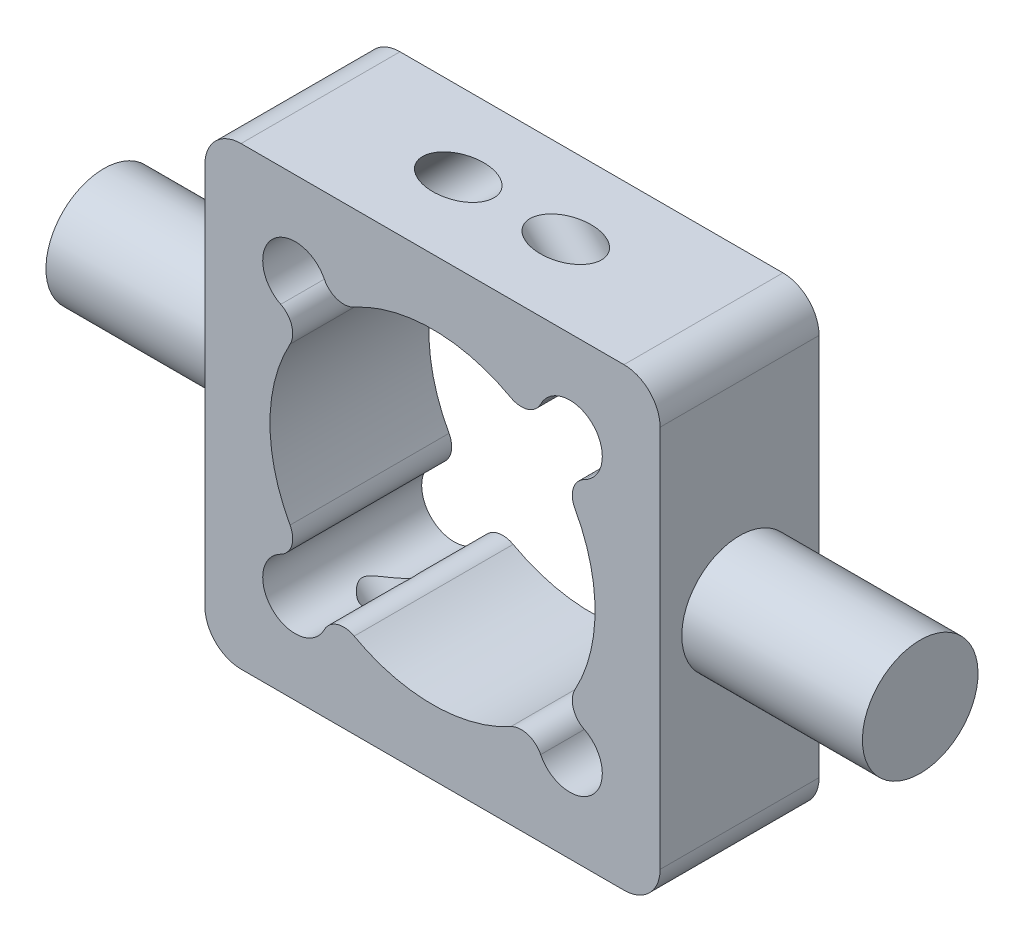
ISO-10303-21;
HEADER;
FILE_DESCRIPTION(('STEP AP214'),'2;1');
FILE_NAME('part.step','',(''),(''),'','','');
FILE_SCHEMA(('AUTOMOTIVE_DESIGN { 1 0 10303 214 1 1 1 1 }'));
ENDSEC;
DATA;
#1=APPLICATION_CONTEXT('core data for automotive mechanical design processes');
#2=APPLICATION_PROTOCOL_DEFINITION('international standard','automotive_design',2000,#1);
#3=PRODUCT_CONTEXT('',#1,'mechanical');
#4=PRODUCT('Part','Part','',(#3));
#5=PRODUCT_RELATED_PRODUCT_CATEGORY('part','',(#4));
#6=PRODUCT_DEFINITION_FORMATION('','',#4);
#7=PRODUCT_DEFINITION_CONTEXT('part definition',#1,'design');
#8=PRODUCT_DEFINITION('design','',#6,#7);
#9=PRODUCT_DEFINITION_SHAPE('','',#8);
#10=(LENGTH_UNIT() NAMED_UNIT(*) SI_UNIT(.MILLI.,.METRE.));
#11=(NAMED_UNIT(*) PLANE_ANGLE_UNIT() SI_UNIT($,.RADIAN.));
#12=(NAMED_UNIT(*) SI_UNIT($,.STERADIAN.) SOLID_ANGLE_UNIT());
#13=UNCERTAINTY_MEASURE_WITH_UNIT(LENGTH_MEASURE(1.E-05),#10,'distance_accuracy_value','');
#14=(GEOMETRIC_REPRESENTATION_CONTEXT(3) GLOBAL_UNCERTAINTY_ASSIGNED_CONTEXT((#13)) GLOBAL_UNIT_ASSIGNED_CONTEXT((#10,
#11,#12)) REPRESENTATION_CONTEXT('',''));
#15=CARTESIAN_POINT('',(0.,0.,0.));
#16=DIRECTION('',(0.,0.,1.));
#17=DIRECTION('',(1.,0.,0.));
#18=AXIS2_PLACEMENT_3D('',#15,#16,#17);
#19=CARTESIAN_POINT('',(-31.5,-31.5,22.));
#20=DIRECTION('',(0.,1.,0.));
#21=DIRECTION('',(-1.,0.,0.));
#22=AXIS2_PLACEMENT_3D('',#19,#20,#21);
#23=PLANE('',#22);
#24=DIRECTION('',(1.,0.,0.));
#25=VECTOR('',#24,1.);
#26=CARTESIAN_POINT('',(-31.5,-31.5,0.));
#27=LINE('',#26,#25);
#28=CARTESIAN_POINT('',(-26.5,-31.5,0.));
#29=VERTEX_POINT('',#28);
#30=CARTESIAN_POINT('',(26.5,-31.5,0.));
#31=VERTEX_POINT('',#30);
#32=EDGE_CURVE('E270',#29,#31,#27,.T.);
#33=ORIENTED_EDGE('',*,*,#32,.T.);
#34=DIRECTION('',(0.,0.,-1.));
#35=VECTOR('',#34,1.);
#36=CARTESIAN_POINT('',(26.5,-31.5,22.));
#37=LINE('',#36,#35);
#38=CARTESIAN_POINT('',(26.5,-31.5,22.));
#39=VERTEX_POINT('',#38);
#40=EDGE_CURVE('E309',#31,#39,#37,.F.);
#41=ORIENTED_EDGE('',*,*,#40,.T.);
#42=DIRECTION('',(1.,0.,0.));
#43=VECTOR('',#42,1.);
#44=CARTESIAN_POINT('',(-31.5,-31.5,22.));
#45=LINE('',#44,#43);
#46=CARTESIAN_POINT('',(-26.5,-31.5,22.));
#47=VERTEX_POINT('',#46);
#48=EDGE_CURVE('E257',#47,#39,#45,.T.);
#49=ORIENTED_EDGE('',*,*,#48,.F.);
#50=DIRECTION('',(0.,0.,-1.));
#51=VECTOR('',#50,1.);
#52=CARTESIAN_POINT('',(-26.5,-31.5,22.));
#53=LINE('',#52,#51);
#54=EDGE_CURVE('E306',#47,#29,#53,.T.);
#55=ORIENTED_EDGE('',*,*,#54,.T.);
#56=EDGE_LOOP('',(#33,#41,#49,#55));
#57=FACE_BOUND('',#56,.T.);
#58=CARTESIAN_POINT('',(7.44112549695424,-31.5,11.));
#59=DIRECTION('',(0.,1.,0.));
#60=DIRECTION('',(-1.,0.,0.));
#61=AXIS2_PLACEMENT_3D('',#58,#59,#60);
#62=ELLIPSE('',#61,4.94974746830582,3.5);
#63=CARTESIAN_POINT('',(2.49137802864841,-31.5,11.));
#64=VERTEX_POINT('',#63);
#65=EDGE_CURVE('E398',#64,#64,#62,.T.);
#66=ORIENTED_EDGE('',*,*,#65,.T.);
#67=EDGE_LOOP('',(#66));
#68=FACE_BOUND('',#67,.T.);
#69=CARTESIAN_POINT('',(-7.44112549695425,-31.5,11.));
#70=DIRECTION('',(0.,1.,0.));
#71=DIRECTION('',(1.,0.,0.));
#72=AXIS2_PLACEMENT_3D('',#69,#70,#71);
#73=ELLIPSE('',#72,4.94974746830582,3.5);
#74=CARTESIAN_POINT('',(-2.49137802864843,-31.5,11.));
#75=VERTEX_POINT('',#74);
#76=EDGE_CURVE('E229',#75,#75,#73,.F.);
#77=ORIENTED_EDGE('',*,*,#76,.F.);
#78=EDGE_LOOP('',(#77));
#79=FACE_BOUND('',#78,.T.);
#80=ADVANCED_FACE('F31',(#57,#68,#79),#23,.F.);
#81=CARTESIAN_POINT('',(-19.,-19.,22.));
#82=DIRECTION('',(0.,0.,-1.));
#83=DIRECTION('',(-1.,0.,0.));
#84=AXIS2_PLACEMENT_3D('',#81,#82,#83);
#85=CYLINDRICAL_SURFACE('',#84,4.5);
#86=DIRECTION('',(0.,0.,-1.));
#87=VECTOR('',#86,1.);
#88=CARTESIAN_POINT('',(-14.9722172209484,-21.0067301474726,22.));
#89=LINE('',#88,#87);
#90=CARTESIAN_POINT('',(-14.9722172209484,-21.0067301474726,22.));
#91=VERTEX_POINT('',#90);
#92=CARTESIAN_POINT('',(-14.9722172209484,-21.0067301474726,13.8040596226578));
#93=VERTEX_POINT('',#92);
#94=EDGE_CURVE('E228',#91,#93,#89,.T.);
#95=ORIENTED_EDGE('',*,*,#94,.T.);
#96=CARTESIAN_POINT('',(-14.9722172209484,-21.0067301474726,13.8040596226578));
#97=CARTESIAN_POINT('',(-15.0033263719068,-21.069182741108,13.8534822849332));
#98=CARTESIAN_POINT('',(-15.0365926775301,-21.1323010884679,13.90073958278));
#99=CARTESIAN_POINT('',(-15.1076307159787,-21.2593698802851,13.9906299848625));
#100=CARTESIAN_POINT('',(-15.1454057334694,-21.323320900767,14.0332596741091));
#101=CARTESIAN_POINT('',(-15.2257692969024,-21.4517214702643,14.1136902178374));
#102=CARTESIAN_POINT('',(-15.2683766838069,-21.5161719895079,14.151470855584));
#103=CARTESIAN_POINT('',(-15.3583068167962,-21.6446616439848,14.2216427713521));
#104=CARTESIAN_POINT('',(-15.4056284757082,-21.7087008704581,14.254035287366));
#105=CARTESIAN_POINT('',(-15.5551734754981,-21.8998813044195,14.3429157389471));
#106=CARTESIAN_POINT('',(-15.6646671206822,-22.0255796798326,14.3907904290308));
#107=CARTESIAN_POINT('',(-15.9007594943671,-22.2669766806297,14.4613019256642));
#108=CARTESIAN_POINT('',(-16.0273134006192,-22.3827002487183,14.4840034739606));
#109=CARTESIAN_POINT('',(-16.283907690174,-22.591391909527,14.5032705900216));
#110=CARTESIAN_POINT('',(-16.4129514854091,-22.685421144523,14.5016920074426));
#111=CARTESIAN_POINT('',(-16.6790145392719,-22.8585302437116,14.4779923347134));
#112=CARTESIAN_POINT('',(-16.8160406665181,-22.937596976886,14.4558533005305));
#113=CARTESIAN_POINT('',(-17.095898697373,-23.0803681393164,14.3927642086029));
#114=CARTESIAN_POINT('',(-17.2387822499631,-23.1438645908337,14.3515786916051));
#115=CARTESIAN_POINT('',(-17.5252446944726,-23.2542589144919,14.253050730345));
#116=CARTESIAN_POINT('',(-17.6688237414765,-23.3011528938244,14.1957045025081));
#117=CARTESIAN_POINT('',(-18.0220108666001,-23.3978493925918,14.0369099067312));
#118=CARTESIAN_POINT('',(-18.2305916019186,-23.4384553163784,13.9274511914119));
#119=CARTESIAN_POINT('',(-18.5358908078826,-23.4771905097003,13.7462414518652));
#120=CARTESIAN_POINT('',(-18.6365690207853,-23.4864031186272,13.6828721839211));
#121=CARTESIAN_POINT('',(-18.8349021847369,-23.4980644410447,13.5509901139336));
#122=CARTESIAN_POINT('',(-18.9325581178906,-23.5005153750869,13.4824790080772));
#123=CARTESIAN_POINT('',(-19.1265064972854,-23.4992910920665,13.3391459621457));
#124=CARTESIAN_POINT('',(-19.2227175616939,-23.4954754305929,13.264216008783));
#125=CARTESIAN_POINT('',(-19.4108798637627,-23.4821943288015,13.1097014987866));
#126=CARTESIAN_POINT('',(-19.5028320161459,-23.4727301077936,13.0301179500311));
#127=CARTESIAN_POINT('',(-19.6816207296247,-23.4489889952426,12.8664912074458));
#128=CARTESIAN_POINT('',(-19.7684689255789,-23.4347235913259,12.7824590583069));
#129=CARTESIAN_POINT('',(-19.9363382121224,-23.4023365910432,12.6095200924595));
#130=CARTESIAN_POINT('',(-20.0173618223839,-23.384216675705,12.520615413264));
#131=CARTESIAN_POINT('',(-20.1704996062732,-23.3458042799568,12.3392250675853));
#132=CARTESIAN_POINT('',(-20.2427704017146,-23.325568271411,12.2468609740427));
#133=CARTESIAN_POINT('',(-20.3783301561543,-23.2843000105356,12.0554720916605));
#134=CARTESIAN_POINT('',(-20.4415941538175,-23.263265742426,11.9564298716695));
#135=CARTESIAN_POINT('',(-20.5559194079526,-23.2228943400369,11.7483703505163));
#136=CARTESIAN_POINT('',(-20.6067417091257,-23.2035943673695,11.6392061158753));
#137=CARTESIAN_POINT('',(-20.6668821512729,-23.1799501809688,11.469326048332));
#138=CARTESIAN_POINT('',(-20.6842207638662,-23.1729651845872,11.4118450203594));
#139=CARTESIAN_POINT('',(-20.7125073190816,-23.1614357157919,11.2951211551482));
#140=CARTESIAN_POINT('',(-20.7234617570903,-23.1568887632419,11.2358801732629));
#141=CARTESIAN_POINT('',(-20.7403281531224,-23.1498661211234,11.0975250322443));
#142=CARTESIAN_POINT('',(-20.7435844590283,-23.1484859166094,11.0180003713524));
#143=CARTESIAN_POINT('',(-20.7368572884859,-23.151304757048,10.8595991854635));
#144=CARTESIAN_POINT('',(-20.7268621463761,-23.1555087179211,10.7807232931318));
#145=CARTESIAN_POINT('',(-20.6906358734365,-23.1703980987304,10.6033758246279));
#146=CARTESIAN_POINT('',(-20.6605381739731,-23.1826090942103,10.5058517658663));
#147=CARTESIAN_POINT('',(-20.5862623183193,-23.2113343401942,10.3169021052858));
#148=CARTESIAN_POINT('',(-20.5420279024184,-23.2278657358,10.225502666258));
#149=CARTESIAN_POINT('',(-20.4448650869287,-23.2620383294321,10.0504476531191));
#150=CARTESIAN_POINT('',(-20.3921438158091,-23.2796480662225,9.96666792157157));
#151=CARTESIAN_POINT('',(-20.2798010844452,-23.3145773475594,9.80375160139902));
#152=CARTESIAN_POINT('',(-20.2201728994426,-23.3318965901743,9.72461965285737));
#153=CARTESIAN_POINT('',(-20.0954643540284,-23.3651042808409,9.57019727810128));
#154=CARTESIAN_POINT('',(-20.0303724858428,-23.3809895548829,9.49491552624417));
#155=CARTESIAN_POINT('',(-19.895811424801,-23.4104730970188,9.34788752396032));
#156=CARTESIAN_POINT('',(-19.8263411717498,-23.4240708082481,9.27614213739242));
#157=CARTESIAN_POINT('',(-19.6527440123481,-23.453613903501,9.10549839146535));
#158=CARTESIAN_POINT('',(-19.5466533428,-23.468019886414,9.00831847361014));
#159=CARTESIAN_POINT('',(-19.3281173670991,-23.4893667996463,8.82041144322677));
#160=CARTESIAN_POINT('',(-19.2156692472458,-23.4963043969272,8.72968722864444));
#161=CARTESIAN_POINT('',(-18.9856508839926,-23.5014436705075,8.55522071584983));
#162=CARTESIAN_POINT('',(-18.8680927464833,-23.4996649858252,8.47146315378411));
#163=CARTESIAN_POINT('',(-18.6285335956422,-23.4862470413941,8.31143963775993));
#164=CARTESIAN_POINT('',(-18.5065329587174,-23.4746086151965,8.23517305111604));
#165=CARTESIAN_POINT('',(-18.2102083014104,-23.4335706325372,8.06279069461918));
#166=CARTESIAN_POINT('',(-18.0341927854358,-23.3989828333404,7.97067990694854));
#167=CARTESIAN_POINT('',(-17.6789843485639,-23.305639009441,7.80723021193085));
#168=CARTESIAN_POINT('',(-17.4997961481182,-23.2469164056,7.73586281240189));
#169=CARTESIAN_POINT('',(-17.1721636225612,-23.1152075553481,7.62833363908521));
#170=CARTESIAN_POINT('',(-17.0234437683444,-23.0460760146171,7.5883404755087));
#171=CARTESIAN_POINT('',(-16.7313277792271,-22.889794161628,7.529446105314));
#172=CARTESIAN_POINT('',(-16.587928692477,-22.8026540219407,7.51053302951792));
#173=CARTESIAN_POINT('',(-16.3103852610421,-22.6117104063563,7.49608677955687));
#174=CARTESIAN_POINT('',(-16.1762843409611,-22.5078354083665,7.50065668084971));
#175=CARTESIAN_POINT('',(-15.9223994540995,-22.2873442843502,7.53432034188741));
#176=CARTESIAN_POINT('',(-15.8026143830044,-22.1707291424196,7.56341220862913));
#177=CARTESIAN_POINT('',(-15.5884039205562,-21.9384025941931,7.64225654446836));
#178=CARTESIAN_POINT('',(-15.4927731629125,-21.8232315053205,7.6903693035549));
#179=CARTESIAN_POINT('',(-15.317319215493,-21.5901988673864,7.80525879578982));
#180=CARTESIAN_POINT('',(-15.237497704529,-21.4723370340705,7.87203750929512));
#181=CARTESIAN_POINT('',(-15.1294280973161,-21.2963987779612,7.98461197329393));
#182=CARTESIAN_POINT('',(-15.0953186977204,-21.2378334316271,8.02425319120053));
#183=CARTESIAN_POINT('',(-15.0309578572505,-21.1215792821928,8.10730912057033));
#184=CARTESIAN_POINT('',(-15.00069505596,-21.0638883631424,8.15071205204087));
#185=CARTESIAN_POINT('',(-14.9722172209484,-21.0067301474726,8.19594037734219));
#186=B_SPLINE_CURVE_WITH_KNOTS('',3,(#96,#97,#98,#99,#100,#101,#102,#103,#104,#105,#106,#107,
#108,#109,#110,#111,#112,#113,#114,#115,#116,#117,#118,#119,#120,#121,#122,#123,#124,#125,#126,
#127,#128,#129,#130,#131,#132,#133,#134,#135,#136,#137,#138,#139,#140,#141,#142,#143,#144,#145,
#146,#147,#148,#149,#150,#151,#152,#153,#154,#155,#156,#157,#158,#159,#160,#161,#162,#163,#164,
#165,#166,#167,#168,#169,#170,#171,#172,#173,#174,#175,#176,#177,#178,#179,#180,#181,#182,#183,
#184,#185),.UNSPECIFIED.,.F.,.F.,(4,2,2,2,2,2,2,2,2,2,2,2,2,2,2,2,2,2,2,2,2,2,2,2,2,2,2,2,2,2,2,
2,2,2,2,2,2,2,2,2,2,2,2,2,4),(0.,0.256478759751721,0.513145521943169,0.770849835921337,
1.02849485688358,1.54577451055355,2.06172068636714,2.53844041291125,3.01557658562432,
3.49877578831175,3.98208821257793,4.69494731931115,5.05266281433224,5.41026082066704,
5.77598305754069,6.14162637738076,6.50640098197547,6.87101682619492,7.22762273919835,
7.5851984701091,7.94918112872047,8.13017059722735,8.31097560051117,8.54843576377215,
8.78610510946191,9.09266950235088,9.4004694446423,9.70165864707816,10.0031436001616,
10.3052802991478,10.6074904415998,11.0407664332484,11.4742357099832,11.9067287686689,
12.3391852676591,12.9418816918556,13.543746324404,14.0480568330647,14.5520832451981,
15.0583239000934,15.5645254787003,16.0342533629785,16.504031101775,16.7394199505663,
16.9740966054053),.UNSPECIFIED.);
#187=CARTESIAN_POINT('',(-14.9722172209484,-21.0067301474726,8.19594037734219));
#188=VERTEX_POINT('',#187);
#189=EDGE_CURVE('E50',#93,#188,#186,.T.);
#190=ORIENTED_EDGE('',*,*,#189,.T.);
#191=CARTESIAN_POINT('',(-14.9722172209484,-21.0067301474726,0.));
#192=VERTEX_POINT('',#191);
#193=EDGE_CURVE('E226',#188,#192,#89,.T.);
#194=ORIENTED_EDGE('',*,*,#193,.T.);
#195=CARTESIAN_POINT('',(-19.,-19.,0.));
#196=DIRECTION('',(0.,0.,1.));
#197=DIRECTION('',(1.,0.,0.));
#198=AXIS2_PLACEMENT_3D('',#195,#196,#197);
#199=CIRCLE('',#198,4.5);
#200=CARTESIAN_POINT('',(-21.0067301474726,-14.9722172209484,0.));
#201=VERTEX_POINT('',#200);
#202=EDGE_CURVE('E506',#201,#192,#199,.T.);
#203=ORIENTED_EDGE('',*,*,#202,.F.);
#204=DIRECTION('',(0.,0.,-1.));
#205=VECTOR('',#204,1.);
#206=CARTESIAN_POINT('',(-21.0067301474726,-14.9722172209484,22.));
#207=LINE('',#206,#205);
#208=CARTESIAN_POINT('',(-21.0067301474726,-14.9722172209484,22.));
#209=VERTEX_POINT('',#208);
#210=EDGE_CURVE('E237',#209,#201,#207,.T.);
#211=ORIENTED_EDGE('',*,*,#210,.F.);
#212=CARTESIAN_POINT('',(-19.,-19.,22.));
#213=DIRECTION('',(0.,0.,1.));
#214=DIRECTION('',(1.,0.,0.));
#215=AXIS2_PLACEMENT_3D('',#212,#213,#214);
#216=CIRCLE('',#215,4.5);
#217=EDGE_CURVE('E568',#209,#91,#216,.T.);
#218=ORIENTED_EDGE('',*,*,#217,.T.);
#219=EDGE_LOOP('',(#95,#190,#194,#203,#211,#218));
#220=FACE_BOUND('',#219,.T.);
#221=ADVANCED_FACE('F224',(#220),#85,.F.);
#222=CARTESIAN_POINT('',(-12.2870287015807,-22.3445502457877,22.));
#223=DIRECTION('',(0.,0.,-1.));
#224=DIRECTION('',(-1.,0.,0.));
#225=AXIS2_PLACEMENT_3D('',#222,#223,#224);
#226=CYLINDRICAL_SURFACE('',#225,3.);
#227=ORIENTED_EDGE('',*,*,#193,.F.);
#228=CARTESIAN_POINT('',(-14.9722172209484,-21.0067301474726,8.19594037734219));
#229=CARTESIAN_POINT('',(-14.94112223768,-20.9443012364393,8.24530440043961));
#230=CARTESIAN_POINT('',(-14.908757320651,-20.8848090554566,8.29749943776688));
#231=CARTESIAN_POINT('',(-14.8425739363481,-20.7718278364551,8.40704676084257));
#232=CARTESIAN_POINT('',(-14.808757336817,-20.7183313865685,8.46439251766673));
#233=CARTESIAN_POINT('',(-14.7409011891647,-20.6176521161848,8.58346333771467));
#234=CARTESIAN_POINT('',(-14.706864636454,-20.5704295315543,8.64515661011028));
#235=CARTESIAN_POINT('',(-14.6392671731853,-20.4817346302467,8.77279050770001));
#236=CARTESIAN_POINT('',(-14.6057064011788,-20.4402639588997,8.83873234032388));
#237=CARTESIAN_POINT('',(-14.5073142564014,-20.3245071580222,9.04164441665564));
#238=CARTESIAN_POINT('',(-14.4444190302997,-20.2583807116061,9.18430128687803));
#239=CARTESIAN_POINT('',(-14.3294404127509,-20.1456686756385,9.48145007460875));
#240=CARTESIAN_POINT('',(-14.2773768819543,-20.0991188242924,9.63596303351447));
#241=CARTESIAN_POINT('',(-14.2079954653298,-20.0400029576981,9.88362623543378));
#242=CARTESIAN_POINT('',(-14.185453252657,-20.0214862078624,9.97396886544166));
#243=CARTESIAN_POINT('',(-14.1457338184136,-19.9895830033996,10.1567397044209));
#244=CARTESIAN_POINT('',(-14.1285569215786,-19.9761968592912,10.2491680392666));
#245=CARTESIAN_POINT('',(-14.1000475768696,-19.9543024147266,10.4354597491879));
#246=CARTESIAN_POINT('',(-14.0887133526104,-19.945792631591,10.5293226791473));
#247=CARTESIAN_POINT('',(-14.072189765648,-19.9334702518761,10.71789481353));
#248=CARTESIAN_POINT('',(-14.067000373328,-19.9296576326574,10.8126040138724));
#249=CARTESIAN_POINT('',(-14.0628422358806,-19.9265977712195,11.0054930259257));
#250=CARTESIAN_POINT('',(-14.0640934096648,-19.9275119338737,11.1036802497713));
#251=CARTESIAN_POINT('',(-14.0732899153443,-19.9343006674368,11.2995706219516));
#252=CARTESIAN_POINT('',(-14.0812354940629,-19.940175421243,11.3972737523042));
#253=CARTESIAN_POINT('',(-14.1035934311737,-19.9570226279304,11.5915662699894));
#254=CARTESIAN_POINT('',(-14.1180105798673,-19.9679988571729,11.6881547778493));
#255=CARTESIAN_POINT('',(-14.1528923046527,-19.9952859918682,11.879466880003));
#256=CARTESIAN_POINT('',(-14.1733568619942,-20.0115968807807,11.9741904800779));
#257=CARTESIAN_POINT('',(-14.2197109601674,-20.0498520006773,12.1609706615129));
#258=CARTESIAN_POINT('',(-14.2455916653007,-20.0717870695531,12.2530313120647));
#259=CARTESIAN_POINT('',(-14.3020855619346,-20.1217216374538,12.4340609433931));
#260=CARTESIAN_POINT('',(-14.3327011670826,-20.1497242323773,12.5230283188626));
#261=CARTESIAN_POINT('',(-14.3977253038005,-20.2121836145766,12.6970155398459));
#262=CARTESIAN_POINT('',(-14.4321262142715,-20.2466275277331,12.7820428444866));
#263=CARTESIAN_POINT('',(-14.503751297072,-20.3224577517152,12.9476382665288));
#264=CARTESIAN_POINT('',(-14.5409735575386,-20.3638393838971,13.0282093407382));
#265=CARTESIAN_POINT('',(-14.6115197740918,-20.4473750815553,13.1728074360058));
#266=CARTESIAN_POINT('',(-14.6446143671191,-20.4885249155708,13.2375273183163));
#267=CARTESIAN_POINT('',(-14.7112176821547,-20.5764023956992,13.3628065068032));
#268=CARTESIAN_POINT('',(-14.7447262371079,-20.6231278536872,13.4233674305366));
#269=CARTESIAN_POINT('',(-14.8114818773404,-20.7225949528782,13.5402568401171));
#270=CARTESIAN_POINT('',(-14.8447261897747,-20.7753709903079,13.5965577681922));
#271=CARTESIAN_POINT('',(-14.90979750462,-20.8867228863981,13.7041773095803));
#272=CARTESIAN_POINT('',(-14.9416225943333,-20.9453062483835,13.7554893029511));
#273=CARTESIAN_POINT('',(-14.9722172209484,-21.0067301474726,13.8040596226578));
#274=B_SPLINE_CURVE_WITH_KNOTS('',3,(#228,#229,#230,#231,#232,#233,#234,#235,#236,#237,#238,
#239,#240,#241,#242,#243,#244,#245,#246,#247,#248,#249,#250,#251,#252,#253,#254,#255,#256,#257,
#258,#259,#260,#261,#262,#263,#264,#265,#266,#267,#268,#269,#270,#271,#272,#273),.UNSPECIFIED.,
.F.,.F.,(4,2,2,2,2,2,2,2,2,2,2,2,2,2,2,2,2,2,2,2,2,2,4),(0.,0.25616436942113,0.512008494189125,
0.766144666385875,1.02035338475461,1.52623689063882,2.03303994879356,2.31757525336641,
2.60212777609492,2.88659373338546,3.17105831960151,3.46529930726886,3.75955114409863,
4.05402114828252,4.34849023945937,4.6424826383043,4.9366253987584,5.23018642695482,
5.52355027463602,5.77386978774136,6.02409138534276,6.27581345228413,6.52786510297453),.UNSPECIFIED.);
#275=EDGE_CURVE('E11',#188,#93,#274,.T.);
#276=ORIENTED_EDGE('',*,*,#275,.T.);
#277=ORIENTED_EDGE('',*,*,#94,.F.);
#278=CARTESIAN_POINT('',(-12.2870287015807,-22.3445502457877,22.));
#279=DIRECTION('',(0.,0.,-1.));
#280=DIRECTION('',(1.,0.,0.));
#281=AXIS2_PLACEMENT_3D('',#278,#279,#280);
#282=CIRCLE('',#281,3.);
#283=CARTESIAN_POINT('',(-10.8414959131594,-19.7157796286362,22.));
#284=VERTEX_POINT('',#283);
#285=EDGE_CURVE('E575',#91,#284,#282,.T.);
#286=ORIENTED_EDGE('',*,*,#285,.T.);
#287=DIRECTION('',(0.,0.,-1.));
#288=VECTOR('',#287,1.);
#289=CARTESIAN_POINT('',(-10.8414959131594,-19.7157796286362,22.));
#290=LINE('',#289,#288);
#291=CARTESIAN_POINT('',(-10.8414959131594,-19.7157796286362,0.));
#292=VERTEX_POINT('',#291);
#293=EDGE_CURVE('E235',#284,#292,#290,.T.);
#294=ORIENTED_EDGE('',*,*,#293,.T.);
#295=CARTESIAN_POINT('',(-12.2870287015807,-22.3445502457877,0.));
#296=DIRECTION('',(0.,0.,-1.));
#297=DIRECTION('',(1.,0.,0.));
#298=AXIS2_PLACEMENT_3D('',#295,#296,#297);
#299=CIRCLE('',#298,3.);
#300=EDGE_CURVE('E233',#192,#292,#299,.T.);
#301=ORIENTED_EDGE('',*,*,#300,.F.);
#302=EDGE_LOOP('',(#227,#276,#277,#286,#294,#301));
#303=FACE_BOUND('',#302,.T.);
#304=ADVANCED_FACE('F231',(#303),#226,.T.);
#305=CARTESIAN_POINT('',(-31.5,31.5,22.));
#306=DIRECTION('',(0.,-1.,0.));
#307=DIRECTION('',(0.,0.,-1.));
#308=AXIS2_PLACEMENT_3D('',#305,#306,#307);
#309=PLANE('',#308);
#310=CARTESIAN_POINT('',(-7.44112549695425,31.5,11.));
#311=DIRECTION('',(0.,-1.,0.));
#312=DIRECTION('',(1.,0.,0.));
#313=AXIS2_PLACEMENT_3D('',#310,#311,#312);
#314=ELLIPSE('',#313,4.94974746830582,3.5);
#315=CARTESIAN_POINT('',(-2.49137802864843,31.5,11.));
#316=VERTEX_POINT('',#315);
#317=EDGE_CURVE('E354',#316,#316,#314,.T.);
#318=ORIENTED_EDGE('',*,*,#317,.T.);
#319=EDGE_LOOP('',(#318));
#320=FACE_BOUND('',#319,.T.);
#321=DIRECTION('',(-1.,0.,0.));
#322=VECTOR('',#321,1.);
#323=CARTESIAN_POINT('',(-31.5,31.5,22.));
#324=LINE('',#323,#322);
#325=CARTESIAN_POINT('',(26.5,31.5,22.));
#326=VERTEX_POINT('',#325);
#327=CARTESIAN_POINT('',(-26.5,31.5,22.));
#328=VERTEX_POINT('',#327);
#329=EDGE_CURVE('E264',#326,#328,#324,.T.);
#330=ORIENTED_EDGE('',*,*,#329,.F.);
#331=DIRECTION('',(0.,0.,-1.));
#332=VECTOR('',#331,1.);
#333=CARTESIAN_POINT('',(26.5,31.5,22.));
#334=LINE('',#333,#332);
#335=CARTESIAN_POINT('',(26.5,31.5,0.));
#336=VERTEX_POINT('',#335);
#337=EDGE_CURVE('E282',#326,#336,#334,.T.);
#338=ORIENTED_EDGE('',*,*,#337,.T.);
#339=DIRECTION('',(-1.,0.,0.));
#340=VECTOR('',#339,1.);
#341=CARTESIAN_POINT('',(-31.5,31.5,0.));
#342=LINE('',#341,#340);
#343=CARTESIAN_POINT('',(-26.5,31.5,0.));
#344=VERTEX_POINT('',#343);
#345=EDGE_CURVE('E258',#336,#344,#342,.T.);
#346=ORIENTED_EDGE('',*,*,#345,.T.);
#347=DIRECTION('',(0.,0.,-1.));
#348=VECTOR('',#347,1.);
#349=CARTESIAN_POINT('',(-26.5,31.5,22.));
#350=LINE('',#349,#348);
#351=EDGE_CURVE('E280',#344,#328,#350,.F.);
#352=ORIENTED_EDGE('',*,*,#351,.T.);
#353=EDGE_LOOP('',(#330,#338,#346,#352));
#354=FACE_BOUND('',#353,.T.);
#355=CARTESIAN_POINT('',(7.44112549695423,31.5,11.));
#356=DIRECTION('',(0.,-1.,0.));
#357=DIRECTION('',(-1.,0.,0.));
#358=AXIS2_PLACEMENT_3D('',#355,#356,#357);
#359=ELLIPSE('',#358,4.94974746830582,3.5);
#360=CARTESIAN_POINT('',(2.49137802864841,31.5,11.));
#361=VERTEX_POINT('',#360);
#362=EDGE_CURVE('E353',#361,#361,#359,.F.);
#363=ORIENTED_EDGE('',*,*,#362,.F.);
#364=EDGE_LOOP('',(#363));
#365=FACE_BOUND('',#364,.T.);
#366=ADVANCED_FACE('F361',(#320,#354,#365),#309,.F.);
#367=CARTESIAN_POINT('',(19.,19.,22.));
#368=DIRECTION('',(0.,0.,-1.));
#369=DIRECTION('',(-1.,0.,0.));
#370=AXIS2_PLACEMENT_3D('',#367,#368,#369);
#371=CYLINDRICAL_SURFACE('',#370,4.5);
#372=DIRECTION('',(0.,0.,-1.));
#373=VECTOR('',#372,1.);
#374=CARTESIAN_POINT('',(14.9722172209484,21.0067301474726,22.));
#375=LINE('',#374,#373);
#376=CARTESIAN_POINT('',(14.9722172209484,21.0067301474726,22.));
#377=VERTEX_POINT('',#376);
#378=CARTESIAN_POINT('',(14.9722172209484,21.0067301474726,13.8040596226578));
#379=VERTEX_POINT('',#378);
#380=EDGE_CURVE('E539',#377,#379,#375,.T.);
#381=ORIENTED_EDGE('',*,*,#380,.T.);
#382=CARTESIAN_POINT('',(14.9722172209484,21.0067301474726,13.8040596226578));
#383=CARTESIAN_POINT('',(15.0033263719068,21.069182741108,13.8534822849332));
#384=CARTESIAN_POINT('',(15.0365926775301,21.1323010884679,13.9007395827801));
#385=CARTESIAN_POINT('',(15.1076307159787,21.2593698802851,13.9906299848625));
#386=CARTESIAN_POINT('',(15.1454057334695,21.323320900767,14.0332596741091));
#387=CARTESIAN_POINT('',(15.2257692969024,21.4517214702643,14.1136902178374));
#388=CARTESIAN_POINT('',(15.2683766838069,21.516171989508,14.151470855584));
#389=CARTESIAN_POINT('',(15.3583068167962,21.6446616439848,14.2216427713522));
#390=CARTESIAN_POINT('',(15.4056284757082,21.7087008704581,14.254035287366));
#391=CARTESIAN_POINT('',(15.5551734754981,21.8998813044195,14.3429157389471));
#392=CARTESIAN_POINT('',(15.6646671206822,22.0255796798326,14.3907904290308));
#393=CARTESIAN_POINT('',(15.9007594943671,22.2669766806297,14.4613019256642));
#394=CARTESIAN_POINT('',(16.0273134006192,22.3827002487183,14.4840034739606));
#395=CARTESIAN_POINT('',(16.283907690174,22.591391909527,14.5032705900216));
#396=CARTESIAN_POINT('',(16.4129514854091,22.685421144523,14.5016920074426));
#397=CARTESIAN_POINT('',(16.6790145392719,22.8585302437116,14.4779923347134));
#398=CARTESIAN_POINT('',(16.8160406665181,22.937596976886,14.4558533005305));
#399=CARTESIAN_POINT('',(17.095898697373,23.0803681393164,14.3927642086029));
#400=CARTESIAN_POINT('',(17.2387822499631,23.1438645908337,14.3515786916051));
#401=CARTESIAN_POINT('',(17.5252446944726,23.2542589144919,14.253050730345));
#402=CARTESIAN_POINT('',(17.6688237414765,23.3011528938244,14.1957045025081));
#403=CARTESIAN_POINT('',(18.0220108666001,23.3978493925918,14.0369099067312));
#404=CARTESIAN_POINT('',(18.2305916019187,23.4384553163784,13.9274511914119));
#405=CARTESIAN_POINT('',(18.5358908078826,23.4771905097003,13.7462414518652));
#406=CARTESIAN_POINT('',(18.6365690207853,23.4864031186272,13.6828721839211));
#407=CARTESIAN_POINT('',(18.8349021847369,23.4980644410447,13.5509901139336));
#408=CARTESIAN_POINT('',(18.9325581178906,23.5005153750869,13.4824790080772));
#409=CARTESIAN_POINT('',(19.1265064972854,23.4992910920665,13.3391459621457));
#410=CARTESIAN_POINT('',(19.2227175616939,23.4954754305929,13.264216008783));
#411=CARTESIAN_POINT('',(19.4108798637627,23.4821943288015,13.1097014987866));
#412=CARTESIAN_POINT('',(19.5028320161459,23.4727301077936,13.0301179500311));
#413=CARTESIAN_POINT('',(19.6816207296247,23.4489889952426,12.8664912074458));
#414=CARTESIAN_POINT('',(19.7684689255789,23.4347235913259,12.7824590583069));
#415=CARTESIAN_POINT('',(19.9363382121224,23.4023365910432,12.6095200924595));
#416=CARTESIAN_POINT('',(20.0173618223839,23.384216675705,12.520615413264));
#417=CARTESIAN_POINT('',(20.1704996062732,23.3458042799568,12.3392250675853));
#418=CARTESIAN_POINT('',(20.2427704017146,23.325568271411,12.2468609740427));
#419=CARTESIAN_POINT('',(20.3783301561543,23.2843000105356,12.0554720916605));
#420=CARTESIAN_POINT('',(20.4415941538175,23.263265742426,11.9564298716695));
#421=CARTESIAN_POINT('',(20.5559194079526,23.2228943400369,11.7483703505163));
#422=CARTESIAN_POINT('',(20.6067417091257,23.2035943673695,11.6392061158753));
#423=CARTESIAN_POINT('',(20.6668821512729,23.1799501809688,11.469326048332));
#424=CARTESIAN_POINT('',(20.6842207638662,23.1729651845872,11.4118450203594));
#425=CARTESIAN_POINT('',(20.7125073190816,23.1614357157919,11.2951211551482));
#426=CARTESIAN_POINT('',(20.7234617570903,23.1568887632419,11.2358801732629));
#427=CARTESIAN_POINT('',(20.7403281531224,23.1498661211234,11.0975250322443));
#428=CARTESIAN_POINT('',(20.7435844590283,23.1484859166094,11.0180003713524));
#429=CARTESIAN_POINT('',(20.7368572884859,23.151304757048,10.8595991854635));
#430=CARTESIAN_POINT('',(20.7268621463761,23.1555087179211,10.7807232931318));
#431=CARTESIAN_POINT('',(20.6906358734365,23.1703980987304,10.6033758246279));
#432=CARTESIAN_POINT('',(20.6605381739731,23.1826090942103,10.5058517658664));
#433=CARTESIAN_POINT('',(20.5862623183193,23.2113343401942,10.3169021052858));
#434=CARTESIAN_POINT('',(20.5420279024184,23.2278657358,10.225502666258));
#435=CARTESIAN_POINT('',(20.4448650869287,23.2620383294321,10.0504476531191));
#436=CARTESIAN_POINT('',(20.3921438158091,23.2796480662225,9.96666792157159));
#437=CARTESIAN_POINT('',(20.2798010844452,23.3145773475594,9.80375160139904));
#438=CARTESIAN_POINT('',(20.2201728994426,23.3318965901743,9.72461965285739));
#439=CARTESIAN_POINT('',(20.0954643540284,23.3651042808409,9.5701972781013));
#440=CARTESIAN_POINT('',(20.0303724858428,23.3809895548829,9.49491552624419));
#441=CARTESIAN_POINT('',(19.895811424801,23.4104730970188,9.34788752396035));
#442=CARTESIAN_POINT('',(19.8263411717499,23.4240708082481,9.27614213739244));
#443=CARTESIAN_POINT('',(19.6527440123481,23.453613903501,9.10549839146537));
#444=CARTESIAN_POINT('',(19.5466533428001,23.468019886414,9.00831847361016));
#445=CARTESIAN_POINT('',(19.3281173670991,23.4893667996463,8.82041144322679));
#446=CARTESIAN_POINT('',(19.2156692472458,23.4963043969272,8.72968722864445));
#447=CARTESIAN_POINT('',(18.9856508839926,23.5014436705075,8.55522071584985));
#448=CARTESIAN_POINT('',(18.8680927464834,23.4996649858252,8.47146315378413));
#449=CARTESIAN_POINT('',(18.6285335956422,23.4862470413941,8.31143963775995));
#450=CARTESIAN_POINT('',(18.5065329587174,23.4746086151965,8.23517305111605));
#451=CARTESIAN_POINT('',(18.2102083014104,23.4335706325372,8.06279069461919));
#452=CARTESIAN_POINT('',(18.0341927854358,23.3989828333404,7.97067990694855));
#453=CARTESIAN_POINT('',(17.6789843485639,23.305639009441,7.80723021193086));
#454=CARTESIAN_POINT('',(17.4997961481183,23.2469164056,7.7358628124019));
#455=CARTESIAN_POINT('',(17.1721636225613,23.1152075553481,7.62833363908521));
#456=CARTESIAN_POINT('',(17.0234437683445,23.0460760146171,7.5883404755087));
#457=CARTESIAN_POINT('',(16.7313277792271,22.889794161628,7.529446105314));
#458=CARTESIAN_POINT('',(16.587928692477,22.8026540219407,7.51053302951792));
#459=CARTESIAN_POINT('',(16.3103852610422,22.6117104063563,7.49608677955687));
#460=CARTESIAN_POINT('',(16.1762843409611,22.5078354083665,7.50065668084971));
#461=CARTESIAN_POINT('',(15.9223994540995,22.2873442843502,7.53432034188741));
#462=CARTESIAN_POINT('',(15.8026143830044,22.1707291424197,7.56341220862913));
#463=CARTESIAN_POINT('',(15.5884039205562,21.9384025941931,7.64225654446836));
#464=CARTESIAN_POINT('',(15.4927731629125,21.8232315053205,7.69036930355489));
#465=CARTESIAN_POINT('',(15.317319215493,21.5901988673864,7.80525879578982));
#466=CARTESIAN_POINT('',(15.2374977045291,21.4723370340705,7.87203750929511));
#467=CARTESIAN_POINT('',(15.1294280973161,21.2963987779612,7.98461197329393));
#468=CARTESIAN_POINT('',(15.0953186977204,21.2378334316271,8.02425319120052));
#469=CARTESIAN_POINT('',(15.0309578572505,21.1215792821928,8.10730912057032));
#470=CARTESIAN_POINT('',(15.00069505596,21.0638883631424,8.15071205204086));
#471=CARTESIAN_POINT('',(14.9722172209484,21.0067301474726,8.19594037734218));
#472=B_SPLINE_CURVE_WITH_KNOTS('',3,(#382,#383,#384,#385,#386,#387,#388,#389,#390,#391,#392,
#393,#394,#395,#396,#397,#398,#399,#400,#401,#402,#403,#404,#405,#406,#407,#408,#409,#410,#411,
#412,#413,#414,#415,#416,#417,#418,#419,#420,#421,#422,#423,#424,#425,#426,#427,#428,#429,#430,
#431,#432,#433,#434,#435,#436,#437,#438,#439,#440,#441,#442,#443,#444,#445,#446,#447,#448,#449,
#450,#451,#452,#453,#454,#455,#456,#457,#458,#459,#460,#461,#462,#463,#464,#465,#466,#467,#468,
#469,#470,#471),.UNSPECIFIED.,.F.,.F.,(4,2,2,2,2,2,2,2,2,2,2,2,2,2,2,2,2,2,2,2,2,2,2,2,2,2,2,2,
2,2,2,2,2,2,2,2,2,2,2,2,2,2,2,2,4),(0.,0.25647875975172,0.513145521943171,0.770849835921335,
1.02849485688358,1.54577451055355,2.06172068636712,2.53844041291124,3.01557658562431,
3.49877578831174,3.98208821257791,4.69494731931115,5.05266281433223,5.41026082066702,
5.77598305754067,6.14162637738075,6.50640098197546,6.8710168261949,7.22762273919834,
7.58519847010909,7.94918112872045,8.13017059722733,8.31097560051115,8.54843576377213,
8.78610510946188,9.09266950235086,9.40046944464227,9.70165864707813,10.0031436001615,
10.3052802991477,10.6074904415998,11.0407664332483,11.4742357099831,11.9067287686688,
12.339185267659,12.9418816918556,13.543746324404,14.0480568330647,14.5520832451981,
15.0583239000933,15.5645254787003,16.0342533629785,16.504031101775,16.7394199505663,
16.9740966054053),.UNSPECIFIED.);
#473=CARTESIAN_POINT('',(14.9722172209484,21.0067301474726,8.19594037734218));
#474=VERTEX_POINT('',#473);
#475=EDGE_CURVE('E346',#379,#474,#472,.T.);
#476=ORIENTED_EDGE('',*,*,#475,.T.);
#477=CARTESIAN_POINT('',(14.9722172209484,21.0067301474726,0.));
#478=VERTEX_POINT('',#477);
#479=EDGE_CURVE('E538',#474,#478,#375,.T.);
#480=ORIENTED_EDGE('',*,*,#479,.T.);
#481=CARTESIAN_POINT('',(19.,19.,0.));
#482=DIRECTION('',(0.,0.,1.));
#483=DIRECTION('',(1.,0.,0.));
#484=AXIS2_PLACEMENT_3D('',#481,#482,#483);
#485=CIRCLE('',#484,4.5);
#486=CARTESIAN_POINT('',(21.0067301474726,14.9722172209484,0.));
#487=VERTEX_POINT('',#486);
#488=EDGE_CURVE('E527',#487,#478,#485,.T.);
#489=ORIENTED_EDGE('',*,*,#488,.F.);
#490=DIRECTION('',(0.,0.,-1.));
#491=VECTOR('',#490,1.);
#492=CARTESIAN_POINT('',(21.0067301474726,14.9722172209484,22.));
#493=LINE('',#492,#491);
#494=CARTESIAN_POINT('',(21.0067301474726,14.9722172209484,22.));
#495=VERTEX_POINT('',#494);
#496=EDGE_CURVE('E542',#495,#487,#493,.T.);
#497=ORIENTED_EDGE('',*,*,#496,.F.);
#498=CARTESIAN_POINT('',(19.,19.,22.));
#499=DIRECTION('',(0.,0.,1.));
#500=DIRECTION('',(1.,0.,0.));
#501=AXIS2_PLACEMENT_3D('',#498,#499,#500);
#502=CIRCLE('',#501,4.5);
#503=EDGE_CURVE('E593',#495,#377,#502,.T.);
#504=ORIENTED_EDGE('',*,*,#503,.T.);
#505=EDGE_LOOP('',(#381,#476,#480,#489,#497,#504));
#506=FACE_BOUND('',#505,.T.);
#507=ADVANCED_FACE('F357',(#506),#371,.F.);
#508=CARTESIAN_POINT('',(12.2870287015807,22.3445502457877,22.));
#509=DIRECTION('',(0.,0.,-1.));
#510=DIRECTION('',(-1.,0.,0.));
#511=AXIS2_PLACEMENT_3D('',#508,#509,#510);
#512=CYLINDRICAL_SURFACE('',#511,3.);
#513=ORIENTED_EDGE('',*,*,#479,.F.);
#514=CARTESIAN_POINT('',(14.9722172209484,21.0067301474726,8.19594037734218));
#515=CARTESIAN_POINT('',(14.94112223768,20.9443012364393,8.24530440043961));
#516=CARTESIAN_POINT('',(14.908757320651,20.8848090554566,8.29749943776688));
#517=CARTESIAN_POINT('',(14.8425739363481,20.7718278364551,8.40704676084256));
#518=CARTESIAN_POINT('',(14.808757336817,20.7183313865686,8.46439251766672));
#519=CARTESIAN_POINT('',(14.7409011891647,20.6176521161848,8.58346333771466));
#520=CARTESIAN_POINT('',(14.706864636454,20.5704295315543,8.64515661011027));
#521=CARTESIAN_POINT('',(14.6392671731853,20.4817346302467,8.77279050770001));
#522=CARTESIAN_POINT('',(14.6057064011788,20.4402639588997,8.83873234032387));
#523=CARTESIAN_POINT('',(14.5073142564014,20.3245071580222,9.04164441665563));
#524=CARTESIAN_POINT('',(14.4444190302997,20.2583807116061,9.18430128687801));
#525=CARTESIAN_POINT('',(14.3294404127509,20.1456686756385,9.48145007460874));
#526=CARTESIAN_POINT('',(14.2773768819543,20.0991188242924,9.63596303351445));
#527=CARTESIAN_POINT('',(14.2079954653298,20.0400029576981,9.88362623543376));
#528=CARTESIAN_POINT('',(14.185453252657,20.0214862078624,9.97396886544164));
#529=CARTESIAN_POINT('',(14.1457338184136,19.9895830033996,10.1567397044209));
#530=CARTESIAN_POINT('',(14.1285569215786,19.9761968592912,10.2491680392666));
#531=CARTESIAN_POINT('',(14.1000475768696,19.9543024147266,10.4354597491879));
#532=CARTESIAN_POINT('',(14.0887133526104,19.945792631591,10.5293226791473));
#533=CARTESIAN_POINT('',(14.072189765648,19.9334702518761,10.71789481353));
#534=CARTESIAN_POINT('',(14.067000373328,19.9296576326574,10.8126040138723));
#535=CARTESIAN_POINT('',(14.0628422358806,19.9265977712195,11.0054930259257));
#536=CARTESIAN_POINT('',(14.0640934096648,19.9275119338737,11.1036802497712));
#537=CARTESIAN_POINT('',(14.0732899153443,19.9343006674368,11.2995706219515));
#538=CARTESIAN_POINT('',(14.0812354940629,19.940175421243,11.3972737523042));
#539=CARTESIAN_POINT('',(14.1035934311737,19.9570226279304,11.5915662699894));
#540=CARTESIAN_POINT('',(14.1180105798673,19.9679988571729,11.6881547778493));
#541=CARTESIAN_POINT('',(14.1528923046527,19.9952859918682,11.879466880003));
#542=CARTESIAN_POINT('',(14.1733568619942,20.0115968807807,11.9741904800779));
#543=CARTESIAN_POINT('',(14.2197109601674,20.0498520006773,12.1609706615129));
#544=CARTESIAN_POINT('',(14.2455916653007,20.0717870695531,12.2530313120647));
#545=CARTESIAN_POINT('',(14.3020855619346,20.1217216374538,12.4340609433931));
#546=CARTESIAN_POINT('',(14.3327011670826,20.1497242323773,12.5230283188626));
#547=CARTESIAN_POINT('',(14.3977253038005,20.2121836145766,12.6970155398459));
#548=CARTESIAN_POINT('',(14.4321262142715,20.2466275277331,12.7820428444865));
#549=CARTESIAN_POINT('',(14.5037512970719,20.3224577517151,12.9476382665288));
#550=CARTESIAN_POINT('',(14.5409735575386,20.3638393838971,13.0282093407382));
#551=CARTESIAN_POINT('',(14.6115197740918,20.4473750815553,13.1728074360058));
#552=CARTESIAN_POINT('',(14.644614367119,20.4885249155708,13.2375273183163));
#553=CARTESIAN_POINT('',(14.7112176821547,20.5764023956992,13.3628065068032));
#554=CARTESIAN_POINT('',(14.7447262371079,20.6231278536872,13.4233674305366));
#555=CARTESIAN_POINT('',(14.8114818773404,20.7225949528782,13.5402568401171));
#556=CARTESIAN_POINT('',(14.8447261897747,20.7753709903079,13.5965577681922));
#557=CARTESIAN_POINT('',(14.90979750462,20.8867228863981,13.7041773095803));
#558=CARTESIAN_POINT('',(14.9416225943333,20.9453062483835,13.7554893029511));
#559=CARTESIAN_POINT('',(14.9722172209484,21.0067301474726,13.8040596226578));
#560=B_SPLINE_CURVE_WITH_KNOTS('',3,(#514,#515,#516,#517,#518,#519,#520,#521,#522,#523,#524,
#525,#526,#527,#528,#529,#530,#531,#532,#533,#534,#535,#536,#537,#538,#539,#540,#541,#542,#543,
#544,#545,#546,#547,#548,#549,#550,#551,#552,#553,#554,#555,#556,#557,#558,#559),.UNSPECIFIED.,
.F.,.F.,(4,2,2,2,2,2,2,2,2,2,2,2,2,2,2,2,2,2,2,2,2,2,4),(0.,0.256164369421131,0.512008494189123,
0.766144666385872,1.0203533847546,1.52623689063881,2.03303994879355,2.3175752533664,
2.60212777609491,2.88659373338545,3.17105831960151,3.46529930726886,3.75955114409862,
4.05402114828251,4.34849023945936,4.64248263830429,4.9366253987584,5.23018642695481,
5.52355027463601,5.77386978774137,6.02409138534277,6.27581345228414,6.52786510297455),.UNSPECIFIED.);
#561=EDGE_CURVE('E316',#474,#379,#560,.T.);
#562=ORIENTED_EDGE('',*,*,#561,.T.);
#563=ORIENTED_EDGE('',*,*,#380,.F.);
#564=CARTESIAN_POINT('',(12.2870287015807,22.3445502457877,22.));
#565=DIRECTION('',(0.,0.,-1.));
#566=DIRECTION('',(1.,0.,0.));
#567=AXIS2_PLACEMENT_3D('',#564,#565,#566);
#568=CIRCLE('',#567,3.);
#569=CARTESIAN_POINT('',(10.8414959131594,19.7157796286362,22.));
#570=VERTEX_POINT('',#569);
#571=EDGE_CURVE('E594',#377,#570,#568,.T.);
#572=ORIENTED_EDGE('',*,*,#571,.T.);
#573=DIRECTION('',(0.,0.,-1.));
#574=VECTOR('',#573,1.);
#575=CARTESIAN_POINT('',(10.8414959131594,19.7157796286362,22.));
#576=LINE('',#575,#574);
#577=CARTESIAN_POINT('',(10.8414959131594,19.7157796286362,0.));
#578=VERTEX_POINT('',#577);
#579=EDGE_CURVE('E536',#570,#578,#576,.T.);
#580=ORIENTED_EDGE('',*,*,#579,.T.);
#581=CARTESIAN_POINT('',(12.2870287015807,22.3445502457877,0.));
#582=DIRECTION('',(0.,0.,-1.));
#583=DIRECTION('',(1.,0.,0.));
#584=AXIS2_PLACEMENT_3D('',#581,#582,#583);
#585=CIRCLE('',#584,3.);
#586=EDGE_CURVE('E530',#478,#578,#585,.T.);
#587=ORIENTED_EDGE('',*,*,#586,.F.);
#588=EDGE_LOOP('',(#513,#562,#563,#572,#580,#587));
#589=FACE_BOUND('',#588,.T.);
#590=ADVANCED_FACE('F330',(#589),#512,.T.);
#591=CARTESIAN_POINT('',(-31.5,31.5,22.));
#592=DIRECTION('',(1.,0.,0.));
#593=DIRECTION('',(0.,0.,-1.));
#594=AXIS2_PLACEMENT_3D('',#591,#592,#593);
#595=PLANE('',#594);
#596=DIRECTION('',(0.,-1.,0.));
#597=VECTOR('',#596,1.);
#598=CARTESIAN_POINT('',(-31.5,31.5,0.));
#599=LINE('',#598,#597);
#600=CARTESIAN_POINT('',(-31.5,26.5,0.));
#601=VERTEX_POINT('',#600);
#602=CARTESIAN_POINT('',(-31.5,-26.5,0.));
#603=VERTEX_POINT('',#602);
#604=EDGE_CURVE('E253',#601,#603,#599,.T.);
#605=ORIENTED_EDGE('',*,*,#604,.T.);
#606=DIRECTION('',(0.,0.,-1.));
#607=VECTOR('',#606,1.);
#608=CARTESIAN_POINT('',(-31.5,-26.5,22.));
#609=LINE('',#608,#607);
#610=CARTESIAN_POINT('',(-31.5,-26.5,22.));
#611=VERTEX_POINT('',#610);
#612=EDGE_CURVE('E314',#603,#611,#609,.F.);
#613=ORIENTED_EDGE('',*,*,#612,.T.);
#614=DIRECTION('',(0.,-1.,0.));
#615=VECTOR('',#614,1.);
#616=CARTESIAN_POINT('',(-31.5,31.5,22.));
#617=LINE('',#616,#615);
#618=CARTESIAN_POINT('',(-31.5,26.5,22.));
#619=VERTEX_POINT('',#618);
#620=EDGE_CURVE('E254',#619,#611,#617,.T.);
#621=ORIENTED_EDGE('',*,*,#620,.F.);
#622=DIRECTION('',(0.,0.,-1.));
#623=VECTOR('',#622,1.);
#624=CARTESIAN_POINT('',(-31.5,26.5,22.));
#625=LINE('',#624,#623);
#626=EDGE_CURVE('E311',#619,#601,#625,.T.);
#627=ORIENTED_EDGE('',*,*,#626,.T.);
#628=EDGE_LOOP('',(#605,#613,#621,#627));
#629=FACE_BOUND('',#628,.T.);
#630=CARTESIAN_POINT('',(-31.5,0.,11.));
#631=DIRECTION('',(1.,0.,0.));
#632=DIRECTION('',(0.,0.,-1.));
#633=AXIS2_PLACEMENT_3D('',#630,#631,#632);
#634=CIRCLE('',#633,8.);
#635=CARTESIAN_POINT('',(-31.5,0.,3.));
#636=VERTEX_POINT('',#635);
#637=EDGE_CURVE('E267',#636,#636,#634,.F.);
#638=ORIENTED_EDGE('',*,*,#637,.F.);
#639=EDGE_LOOP('',(#638));
#640=FACE_BOUND('',#639,.T.);
#641=ADVANCED_FACE('F418',(#629,#640),#595,.F.);
#642=CARTESIAN_POINT('',(-31.5,-31.5,22.));
#643=DIRECTION('',(0.,0.,1.));
#644=DIRECTION('',(1.,0.,0.));
#645=AXIS2_PLACEMENT_3D('',#642,#643,#644);
#646=PLANE('',#645);
#647=DIRECTION('',(0.,1.,0.));
#648=VECTOR('',#647,1.);
#649=CARTESIAN_POINT('',(31.5,31.5,22.));
#650=LINE('',#649,#648);
#651=CARTESIAN_POINT('',(31.5,-26.5,22.));
#652=VERTEX_POINT('',#651);
#653=CARTESIAN_POINT('',(31.5,26.5,22.));
#654=VERTEX_POINT('',#653);
#655=EDGE_CURVE('E261',#652,#654,#650,.T.);
#656=ORIENTED_EDGE('',*,*,#655,.T.);
#657=CARTESIAN_POINT('',(26.5,26.5,22.));
#658=DIRECTION('',(0.,0.,1.));
#659=DIRECTION('',(1.,0.,0.));
#660=AXIS2_PLACEMENT_3D('',#657,#658,#659);
#661=CIRCLE('',#660,5.);
#662=EDGE_CURVE('E304',#654,#326,#661,.T.);
#663=ORIENTED_EDGE('',*,*,#662,.T.);
#664=ORIENTED_EDGE('',*,*,#329,.T.);
#665=CARTESIAN_POINT('',(-26.5,26.5,22.));
#666=DIRECTION('',(0.,0.,1.));
#667=DIRECTION('',(1.,0.,0.));
#668=AXIS2_PLACEMENT_3D('',#665,#666,#667);
#669=CIRCLE('',#668,5.);
#670=EDGE_CURVE('E298',#328,#619,#669,.T.);
#671=ORIENTED_EDGE('',*,*,#670,.T.);
#672=ORIENTED_EDGE('',*,*,#620,.T.);
#673=CARTESIAN_POINT('',(-26.5,-26.5,22.));
#674=DIRECTION('',(0.,0.,1.));
#675=DIRECTION('',(1.,0.,0.));
#676=AXIS2_PLACEMENT_3D('',#673,#674,#675);
#677=CIRCLE('',#676,5.);
#678=EDGE_CURVE('E300',#611,#47,#677,.T.);
#679=ORIENTED_EDGE('',*,*,#678,.T.);
#680=ORIENTED_EDGE('',*,*,#48,.T.);
#681=CARTESIAN_POINT('',(26.5,-26.5,22.));
#682=DIRECTION('',(0.,0.,1.));
#683=DIRECTION('',(1.,0.,0.));
#684=AXIS2_PLACEMENT_3D('',#681,#682,#683);
#685=CIRCLE('',#684,5.);
#686=EDGE_CURVE('E302',#39,#652,#685,.T.);
#687=ORIENTED_EDGE('',*,*,#686,.T.);
#688=EDGE_LOOP('',(#656,#663,#664,#671,#672,#679,#680,#687));
#689=FACE_BOUND('',#688,.T.);
#690=CARTESIAN_POINT('',(-19.,19.,22.));
#691=DIRECTION('',(0.,0.,1.));
#692=DIRECTION('',(1.,0.,0.));
#693=AXIS2_PLACEMENT_3D('',#690,#691,#692);
#694=CIRCLE('',#693,4.5);
#695=CARTESIAN_POINT('',(-14.9722172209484,21.0067301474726,22.));
#696=VERTEX_POINT('',#695);
#697=CARTESIAN_POINT('',(-21.0067301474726,14.9722172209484,22.));
#698=VERTEX_POINT('',#697);
#699=EDGE_CURVE('E605',#696,#698,#694,.T.);
#700=ORIENTED_EDGE('',*,*,#699,.F.);
#701=CARTESIAN_POINT('',(-12.2870287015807,22.3445502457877,22.));
#702=DIRECTION('',(0.,0.,-1.));
#703=DIRECTION('',(1.,0.,0.));
#704=AXIS2_PLACEMENT_3D('',#701,#702,#703);
#705=CIRCLE('',#704,3.);
#706=CARTESIAN_POINT('',(-10.8414959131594,19.7157796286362,22.));
#707=VERTEX_POINT('',#706);
#708=EDGE_CURVE('E533',#707,#696,#705,.T.);
#709=ORIENTED_EDGE('',*,*,#708,.F.);
#710=CARTESIAN_POINT('',(0.,0.,22.));
#711=DIRECTION('',(0.,0.,1.));
#712=DIRECTION('',(1.,0.,0.));
#713=AXIS2_PLACEMENT_3D('',#710,#711,#712);
#714=CIRCLE('',#713,22.5);
#715=EDGE_CURVE('E496',#570,#707,#714,.T.);
#716=ORIENTED_EDGE('',*,*,#715,.F.);
#717=ORIENTED_EDGE('',*,*,#571,.F.);
#718=ORIENTED_EDGE('',*,*,#503,.F.);
#719=CARTESIAN_POINT('',(22.3445502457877,12.2870287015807,22.));
#720=DIRECTION('',(0.,0.,-1.));
#721=DIRECTION('',(-1.,0.,0.));
#722=AXIS2_PLACEMENT_3D('',#719,#720,#721);
#723=CIRCLE('',#722,3.);
#724=CARTESIAN_POINT('',(19.7157796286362,10.8414959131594,22.));
#725=VERTEX_POINT('',#724);
#726=EDGE_CURVE('E591',#725,#495,#723,.T.);
#727=ORIENTED_EDGE('',*,*,#726,.F.);
#728=CARTESIAN_POINT('',(0.,0.,22.));
#729=DIRECTION('',(0.,0.,1.));
#730=DIRECTION('',(1.,0.,0.));
#731=AXIS2_PLACEMENT_3D('',#728,#729,#730);
#732=CIRCLE('',#731,22.5);
#733=CARTESIAN_POINT('',(19.7157796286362,-10.8414959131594,22.));
#734=VERTEX_POINT('',#733);
#735=EDGE_CURVE('E589',#734,#725,#732,.T.);
#736=ORIENTED_EDGE('',*,*,#735,.F.);
#737=CARTESIAN_POINT('',(22.3445502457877,-12.2870287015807,22.));
#738=DIRECTION('',(0.,0.,-1.));
#739=DIRECTION('',(1.,0.,0.));
#740=AXIS2_PLACEMENT_3D('',#737,#738,#739);
#741=CIRCLE('',#740,3.);
#742=CARTESIAN_POINT('',(21.0067301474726,-14.9722172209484,22.));
#743=VERTEX_POINT('',#742);
#744=EDGE_CURVE('E587',#743,#734,#741,.T.);
#745=ORIENTED_EDGE('',*,*,#744,.F.);
#746=CARTESIAN_POINT('',(19.,-19.,22.));
#747=DIRECTION('',(0.,0.,1.));
#748=DIRECTION('',(1.,0.,0.));
#749=AXIS2_PLACEMENT_3D('',#746,#747,#748);
#750=CIRCLE('',#749,4.5);
#751=CARTESIAN_POINT('',(14.9722172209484,-21.0067301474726,22.));
#752=VERTEX_POINT('',#751);
#753=EDGE_CURVE('E585',#752,#743,#750,.T.);
#754=ORIENTED_EDGE('',*,*,#753,.F.);
#755=CARTESIAN_POINT('',(12.2870287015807,-22.3445502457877,22.));
#756=DIRECTION('',(0.,0.,-1.));
#757=DIRECTION('',(-1.,0.,0.));
#758=AXIS2_PLACEMENT_3D('',#755,#756,#757);
#759=CIRCLE('',#758,3.);
#760=CARTESIAN_POINT('',(10.8414959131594,-19.7157796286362,22.));
#761=VERTEX_POINT('',#760);
#762=EDGE_CURVE('E583',#761,#752,#759,.T.);
#763=ORIENTED_EDGE('',*,*,#762,.F.);
#764=CARTESIAN_POINT('',(0.,0.,22.));
#765=DIRECTION('',(0.,0.,1.));
#766=DIRECTION('',(1.,0.,0.));
#767=AXIS2_PLACEMENT_3D('',#764,#765,#766);
#768=CIRCLE('',#767,22.5);
#769=EDGE_CURVE('E560',#284,#761,#768,.T.);
#770=ORIENTED_EDGE('',*,*,#769,.F.);
#771=ORIENTED_EDGE('',*,*,#285,.F.);
#772=ORIENTED_EDGE('',*,*,#217,.F.);
#773=CARTESIAN_POINT('',(-22.3445502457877,-12.2870287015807,22.));
#774=DIRECTION('',(0.,0.,-1.));
#775=DIRECTION('',(1.,0.,0.));
#776=AXIS2_PLACEMENT_3D('',#773,#774,#775);
#777=CIRCLE('',#776,3.);
#778=CARTESIAN_POINT('',(-19.7157796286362,-10.8414959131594,22.));
#779=VERTEX_POINT('',#778);
#780=EDGE_CURVE('E574',#779,#209,#777,.T.);
#781=ORIENTED_EDGE('',*,*,#780,.F.);
#782=CARTESIAN_POINT('',(0.,0.,22.));
#783=DIRECTION('',(0.,0.,1.));
#784=DIRECTION('',(1.,0.,0.));
#785=AXIS2_PLACEMENT_3D('',#782,#783,#784);
#786=CIRCLE('',#785,22.5);
#787=CARTESIAN_POINT('',(-19.7157796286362,10.8414959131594,22.));
#788=VERTEX_POINT('',#787);
#789=EDGE_CURVE('E578',#788,#779,#786,.T.);
#790=ORIENTED_EDGE('',*,*,#789,.F.);
#791=CARTESIAN_POINT('',(-22.3445502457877,12.2870287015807,22.));
#792=DIRECTION('',(0.,0.,-1.));
#793=DIRECTION('',(1.,0.,0.));
#794=AXIS2_PLACEMENT_3D('',#791,#792,#793);
#795=CIRCLE('',#794,3.);
#796=EDGE_CURVE('E607',#698,#788,#795,.T.);
#797=ORIENTED_EDGE('',*,*,#796,.F.);
#798=EDGE_LOOP('',(#700,#709,#716,#717,#718,#727,#736,#745,#754,#763,#770,#771,#772,#781,#790,#797));
#799=FACE_BOUND('',#798,.T.);
#800=ADVANCED_FACE('F414',(#689,#799),#646,.T.);
#801=CARTESIAN_POINT('',(-31.5,-31.5,0.));
#802=DIRECTION('',(0.,0.,1.));
#803=DIRECTION('',(1.,0.,0.));
#804=AXIS2_PLACEMENT_3D('',#801,#802,#803);
#805=PLANE('',#804);
#806=ORIENTED_EDGE('',*,*,#345,.F.);
#807=CARTESIAN_POINT('',(26.5,26.5,0.));
#808=DIRECTION('',(0.,0.,1.));
#809=DIRECTION('',(1.,0.,0.));
#810=AXIS2_PLACEMENT_3D('',#807,#808,#809);
#811=CIRCLE('',#810,5.);
#812=CARTESIAN_POINT('',(31.5,26.5,0.));
#813=VERTEX_POINT('',#812);
#814=EDGE_CURVE('E291',#336,#813,#811,.F.);
#815=ORIENTED_EDGE('',*,*,#814,.T.);
#816=DIRECTION('',(0.,1.,0.));
#817=VECTOR('',#816,1.);
#818=CARTESIAN_POINT('',(31.5,31.5,0.));
#819=LINE('',#818,#817);
#820=CARTESIAN_POINT('',(31.5,-26.5,0.));
#821=VERTEX_POINT('',#820);
#822=EDGE_CURVE('E273',#821,#813,#819,.T.);
#823=ORIENTED_EDGE('',*,*,#822,.F.);
#824=CARTESIAN_POINT('',(26.5,-26.5,0.));
#825=DIRECTION('',(0.,0.,1.));
#826=DIRECTION('',(1.,0.,0.));
#827=AXIS2_PLACEMENT_3D('',#824,#825,#826);
#828=CIRCLE('',#827,5.);
#829=EDGE_CURVE('E289',#821,#31,#828,.F.);
#830=ORIENTED_EDGE('',*,*,#829,.T.);
#831=ORIENTED_EDGE('',*,*,#32,.F.);
#832=CARTESIAN_POINT('',(-26.5,-26.5,0.));
#833=DIRECTION('',(0.,0.,1.));
#834=DIRECTION('',(1.,0.,0.));
#835=AXIS2_PLACEMENT_3D('',#832,#833,#834);
#836=CIRCLE('',#835,5.);
#837=EDGE_CURVE('E287',#29,#603,#836,.F.);
#838=ORIENTED_EDGE('',*,*,#837,.T.);
#839=ORIENTED_EDGE('',*,*,#604,.F.);
#840=CARTESIAN_POINT('',(-26.5,26.5,0.));
#841=DIRECTION('',(0.,0.,1.));
#842=DIRECTION('',(1.,0.,0.));
#843=AXIS2_PLACEMENT_3D('',#840,#841,#842);
#844=CIRCLE('',#843,5.);
#845=EDGE_CURVE('E285',#601,#344,#844,.F.);
#846=ORIENTED_EDGE('',*,*,#845,.T.);
#847=EDGE_LOOP('',(#806,#815,#823,#830,#831,#838,#839,#846));
#848=FACE_BOUND('',#847,.T.);
#849=CARTESIAN_POINT('',(-12.2870287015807,22.3445502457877,0.));
#850=DIRECTION('',(0.,0.,-1.));
#851=DIRECTION('',(1.,0.,0.));
#852=AXIS2_PLACEMENT_3D('',#849,#850,#851);
#853=CIRCLE('',#852,3.);
#854=CARTESIAN_POINT('',(-10.8414959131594,19.7157796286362,0.));
#855=VERTEX_POINT('',#854);
#856=CARTESIAN_POINT('',(-14.9722172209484,21.0067301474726,0.));
#857=VERTEX_POINT('',#856);
#858=EDGE_CURVE('E479',#855,#857,#853,.T.);
#859=ORIENTED_EDGE('',*,*,#858,.T.);
#860=CARTESIAN_POINT('',(-19.,19.,0.));
#861=DIRECTION('',(0.,0.,1.));
#862=DIRECTION('',(1.,0.,0.));
#863=AXIS2_PLACEMENT_3D('',#860,#861,#862);
#864=CIRCLE('',#863,4.5);
#865=CARTESIAN_POINT('',(-21.0067301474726,14.9722172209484,0.));
#866=VERTEX_POINT('',#865);
#867=EDGE_CURVE('E482',#857,#866,#864,.T.);
#868=ORIENTED_EDGE('',*,*,#867,.T.);
#869=CARTESIAN_POINT('',(-22.3445502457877,12.2870287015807,0.));
#870=DIRECTION('',(0.,0.,-1.));
#871=DIRECTION('',(1.,0.,0.));
#872=AXIS2_PLACEMENT_3D('',#869,#870,#871);
#873=CIRCLE('',#872,3.);
#874=CARTESIAN_POINT('',(-19.7157796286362,10.8414959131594,0.));
#875=VERTEX_POINT('',#874);
#876=EDGE_CURVE('E490',#866,#875,#873,.T.);
#877=ORIENTED_EDGE('',*,*,#876,.T.);
#878=CARTESIAN_POINT('',(0.,0.,0.));
#879=DIRECTION('',(0.,0.,1.));
#880=DIRECTION('',(1.,0.,0.));
#881=AXIS2_PLACEMENT_3D('',#878,#879,#880);
#882=CIRCLE('',#881,22.5);
#883=CARTESIAN_POINT('',(-19.7157796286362,-10.8414959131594,0.));
#884=VERTEX_POINT('',#883);
#885=EDGE_CURVE('E500',#875,#884,#882,.T.);
#886=ORIENTED_EDGE('',*,*,#885,.T.);
#887=CARTESIAN_POINT('',(-22.3445502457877,-12.2870287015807,0.));
#888=DIRECTION('',(0.,0.,-1.));
#889=DIRECTION('',(1.,0.,0.));
#890=AXIS2_PLACEMENT_3D('',#887,#888,#889);
#891=CIRCLE('',#890,3.);
#892=EDGE_CURVE('E503',#884,#201,#891,.T.);
#893=ORIENTED_EDGE('',*,*,#892,.T.);
#894=ORIENTED_EDGE('',*,*,#202,.T.);
#895=ORIENTED_EDGE('',*,*,#300,.T.);
#896=CARTESIAN_POINT('',(0.,0.,0.));
#897=DIRECTION('',(0.,0.,1.));
#898=DIRECTION('',(1.,0.,0.));
#899=AXIS2_PLACEMENT_3D('',#896,#897,#898);
#900=CIRCLE('',#899,22.5);
#901=CARTESIAN_POINT('',(10.8414959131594,-19.7157796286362,0.));
#902=VERTEX_POINT('',#901);
#903=EDGE_CURVE('E509',#292,#902,#900,.T.);
#904=ORIENTED_EDGE('',*,*,#903,.T.);
#905=CARTESIAN_POINT('',(12.2870287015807,-22.3445502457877,0.));
#906=DIRECTION('',(0.,0.,-1.));
#907=DIRECTION('',(-1.,0.,0.));
#908=AXIS2_PLACEMENT_3D('',#905,#906,#907);
#909=CIRCLE('',#908,3.);
#910=CARTESIAN_POINT('',(14.9722172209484,-21.0067301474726,0.));
#911=VERTEX_POINT('',#910);
#912=EDGE_CURVE('E512',#902,#911,#909,.T.);
#913=ORIENTED_EDGE('',*,*,#912,.T.);
#914=CARTESIAN_POINT('',(19.,-19.,0.));
#915=DIRECTION('',(0.,0.,1.));
#916=DIRECTION('',(1.,0.,0.));
#917=AXIS2_PLACEMENT_3D('',#914,#915,#916);
#918=CIRCLE('',#917,4.5);
#919=CARTESIAN_POINT('',(21.0067301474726,-14.9722172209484,0.));
#920=VERTEX_POINT('',#919);
#921=EDGE_CURVE('E515',#911,#920,#918,.T.);
#922=ORIENTED_EDGE('',*,*,#921,.T.);
#923=CARTESIAN_POINT('',(22.3445502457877,-12.2870287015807,0.));
#924=DIRECTION('',(0.,0.,-1.));
#925=DIRECTION('',(1.,0.,0.));
#926=AXIS2_PLACEMENT_3D('',#923,#924,#925);
#927=CIRCLE('',#926,3.);
#928=CARTESIAN_POINT('',(19.7157796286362,-10.8414959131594,0.));
#929=VERTEX_POINT('',#928);
#930=EDGE_CURVE('E518',#920,#929,#927,.T.);
#931=ORIENTED_EDGE('',*,*,#930,.T.);
#932=CARTESIAN_POINT('',(0.,0.,0.));
#933=DIRECTION('',(0.,0.,1.));
#934=DIRECTION('',(1.,0.,0.));
#935=AXIS2_PLACEMENT_3D('',#932,#933,#934);
#936=CIRCLE('',#935,22.5);
#937=CARTESIAN_POINT('',(19.7157796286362,10.8414959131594,0.));
#938=VERTEX_POINT('',#937);
#939=EDGE_CURVE('E521',#929,#938,#936,.T.);
#940=ORIENTED_EDGE('',*,*,#939,.T.);
#941=CARTESIAN_POINT('',(22.3445502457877,12.2870287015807,0.));
#942=DIRECTION('',(0.,0.,-1.));
#943=DIRECTION('',(-1.,0.,0.));
#944=AXIS2_PLACEMENT_3D('',#941,#942,#943);
#945=CIRCLE('',#944,3.);
#946=EDGE_CURVE('E524',#938,#487,#945,.T.);
#947=ORIENTED_EDGE('',*,*,#946,.T.);
#948=ORIENTED_EDGE('',*,*,#488,.T.);
#949=ORIENTED_EDGE('',*,*,#586,.T.);
#950=CARTESIAN_POINT('',(0.,0.,0.));
#951=DIRECTION('',(0.,0.,1.));
#952=DIRECTION('',(1.,0.,0.));
#953=AXIS2_PLACEMENT_3D('',#950,#951,#952);
#954=CIRCLE('',#953,22.5);
#955=EDGE_CURVE('E485',#578,#855,#954,.T.);
#956=ORIENTED_EDGE('',*,*,#955,.T.);
#957=EDGE_LOOP('',(#859,#868,#877,#886,#893,#894,#895,#904,#913,#922,#931,#940,#947,#948,#949,#956));
#958=FACE_BOUND('',#957,.T.);
#959=ADVANCED_FACE('F417',(#848,#958),#805,.F.);
#960=CARTESIAN_POINT('',(31.5,31.5,22.));
#961=DIRECTION('',(-1.,0.,0.));
#962=DIRECTION('',(0.,-1.,0.));
#963=AXIS2_PLACEMENT_3D('',#960,#961,#962);
#964=PLANE('',#963);
#965=CARTESIAN_POINT('',(31.5,0.,11.));
#966=DIRECTION('',(-1.,0.,0.));
#967=DIRECTION('',(0.,-1.,0.));
#968=AXIS2_PLACEMENT_3D('',#965,#966,#967);
#969=CIRCLE('',#968,8.);
#970=CARTESIAN_POINT('',(31.5,-8.,11.));
#971=VERTEX_POINT('',#970);
#972=EDGE_CURVE('E870',#971,#971,#969,.T.);
#973=ORIENTED_EDGE('',*,*,#972,.T.);
#974=EDGE_LOOP('',(#973));
#975=FACE_BOUND('',#974,.T.);
#976=ORIENTED_EDGE('',*,*,#822,.T.);
#977=DIRECTION('',(0.,0.,-1.));
#978=VECTOR('',#977,1.);
#979=CARTESIAN_POINT('',(31.5,26.5,22.));
#980=LINE('',#979,#978);
#981=EDGE_CURVE('E296',#813,#654,#980,.F.);
#982=ORIENTED_EDGE('',*,*,#981,.T.);
#983=ORIENTED_EDGE('',*,*,#655,.F.);
#984=DIRECTION('',(0.,0.,-1.));
#985=VECTOR('',#984,1.);
#986=CARTESIAN_POINT('',(31.5,-26.5,22.));
#987=LINE('',#986,#985);
#988=EDGE_CURVE('E293',#652,#821,#987,.T.);
#989=ORIENTED_EDGE('',*,*,#988,.T.);
#990=EDGE_LOOP('',(#976,#982,#983,#989));
#991=FACE_BOUND('',#990,.T.);
#992=ADVANCED_FACE('F410',(#975,#991),#964,.F.);
#993=CARTESIAN_POINT('',(-12.2870287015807,22.3445502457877,22.));
#994=DIRECTION('',(0.,0.,-1.));
#995=DIRECTION('',(-1.,0.,0.));
#996=AXIS2_PLACEMENT_3D('',#993,#994,#995);
#997=CYLINDRICAL_SURFACE('',#996,3.);
#998=CARTESIAN_POINT('',(-14.9722172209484,21.0067301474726,8.19594037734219));
#999=CARTESIAN_POINT('',(-14.94112223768,20.9443012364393,8.24530440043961));
#1000=CARTESIAN_POINT('',(-14.908757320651,20.8848090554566,8.29749943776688));
#1001=CARTESIAN_POINT('',(-14.8425739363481,20.7718278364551,8.40704676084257));
#1002=CARTESIAN_POINT('',(-14.808757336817,20.7183313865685,8.46439251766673));
#1003=CARTESIAN_POINT('',(-14.7409011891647,20.6176521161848,8.58346333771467));
#1004=CARTESIAN_POINT('',(-14.706864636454,20.5704295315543,8.64515661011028));
#1005=CARTESIAN_POINT('',(-14.6392671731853,20.4817346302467,8.77279050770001));
#1006=CARTESIAN_POINT('',(-14.6057064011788,20.4402639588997,8.83873234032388));
#1007=CARTESIAN_POINT('',(-14.5073142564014,20.3245071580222,9.04164441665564));
#1008=CARTESIAN_POINT('',(-14.4444190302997,20.2583807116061,9.18430128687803));
#1009=CARTESIAN_POINT('',(-14.3294404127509,20.1456686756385,9.48145007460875));
#1010=CARTESIAN_POINT('',(-14.2773768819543,20.0991188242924,9.63596303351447));
#1011=CARTESIAN_POINT('',(-14.2079954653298,20.0400029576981,9.88362623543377));
#1012=CARTESIAN_POINT('',(-14.185453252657,20.0214862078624,9.97396886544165));
#1013=CARTESIAN_POINT('',(-14.1457338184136,19.9895830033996,10.1567397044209));
#1014=CARTESIAN_POINT('',(-14.1285569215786,19.9761968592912,10.2491680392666));
#1015=CARTESIAN_POINT('',(-14.1000475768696,19.9543024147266,10.4354597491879));
#1016=CARTESIAN_POINT('',(-14.0887133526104,19.945792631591,10.5293226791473));
#1017=CARTESIAN_POINT('',(-14.072189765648,19.9334702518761,10.71789481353));
#1018=CARTESIAN_POINT('',(-14.067000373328,19.9296576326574,10.8126040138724));
#1019=CARTESIAN_POINT('',(-14.0628422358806,19.9265977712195,11.0054930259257));
#1020=CARTESIAN_POINT('',(-14.0640934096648,19.9275119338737,11.1036802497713));
#1021=CARTESIAN_POINT('',(-14.0732899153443,19.9343006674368,11.2995706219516));
#1022=CARTESIAN_POINT('',(-14.0812354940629,19.940175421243,11.3972737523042));
#1023=CARTESIAN_POINT('',(-14.1035934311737,19.9570226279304,11.5915662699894));
#1024=CARTESIAN_POINT('',(-14.1180105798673,19.9679988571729,11.6881547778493));
#1025=CARTESIAN_POINT('',(-14.1528923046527,19.9952859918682,11.879466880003));
#1026=CARTESIAN_POINT('',(-14.1733568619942,20.0115968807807,11.9741904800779));
#1027=CARTESIAN_POINT('',(-14.2197109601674,20.0498520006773,12.1609706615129));
#1028=CARTESIAN_POINT('',(-14.2455916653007,20.0717870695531,12.2530313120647));
#1029=CARTESIAN_POINT('',(-14.3020855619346,20.1217216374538,12.4340609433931));
#1030=CARTESIAN_POINT('',(-14.3327011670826,20.1497242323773,12.5230283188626));
#1031=CARTESIAN_POINT('',(-14.3977253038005,20.2121836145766,12.6970155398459));
#1032=CARTESIAN_POINT('',(-14.4321262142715,20.2466275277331,12.7820428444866));
#1033=CARTESIAN_POINT('',(-14.503751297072,20.3224577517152,12.9476382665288));
#1034=CARTESIAN_POINT('',(-14.5409735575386,20.3638393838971,13.0282093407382));
#1035=CARTESIAN_POINT('',(-14.6115197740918,20.4473750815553,13.1728074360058));
#1036=CARTESIAN_POINT('',(-14.6446143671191,20.4885249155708,13.2375273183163));
#1037=CARTESIAN_POINT('',(-14.7112176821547,20.5764023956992,13.3628065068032));
#1038=CARTESIAN_POINT('',(-14.7447262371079,20.6231278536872,13.4233674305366));
#1039=CARTESIAN_POINT('',(-14.8114818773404,20.7225949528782,13.5402568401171));
#1040=CARTESIAN_POINT('',(-14.8447261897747,20.7753709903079,13.5965577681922));
#1041=CARTESIAN_POINT('',(-14.90979750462,20.8867228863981,13.7041773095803));
#1042=CARTESIAN_POINT('',(-14.9416225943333,20.9453062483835,13.7554893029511));
#1043=CARTESIAN_POINT('',(-14.9722172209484,21.0067301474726,13.8040596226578));
#1044=B_SPLINE_CURVE_WITH_KNOTS('',3,(#998,#999,#1000,#1001,#1002,#1003,#1004,#1005,#1006,#1007,
#1008,#1009,#1010,#1011,#1012,#1013,#1014,#1015,#1016,#1017,#1018,#1019,#1020,#1021,#1022,#1023,
#1024,#1025,#1026,#1027,#1028,#1029,#1030,#1031,#1032,#1033,#1034,#1035,#1036,#1037,#1038,#1039,
#1040,#1041,#1042,#1043),.UNSPECIFIED.,.F.,.F.,(4,2,2,2,2,2,2,2,2,2,2,2,2,2,2,2,2,2,2,2,2,2,4),
(0.,0.25616436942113,0.512008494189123,0.766144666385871,1.02035338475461,1.52623689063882,
2.03303994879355,2.3175752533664,2.60212777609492,2.88659373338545,3.17105831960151,
3.46529930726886,3.75955114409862,4.05402114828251,4.34849023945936,4.64248263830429,
4.9366253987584,5.23018642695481,5.52355027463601,5.77386978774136,6.02409138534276,
6.27581345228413,6.52786510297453),.UNSPECIFIED.);
#1045=CARTESIAN_POINT('',(-14.9722172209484,21.0067301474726,8.19594037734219));
#1046=VERTEX_POINT('',#1045);
#1047=CARTESIAN_POINT('',(-14.9722172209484,21.0067301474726,13.8040596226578));
#1048=VERTEX_POINT('',#1047);
#1049=EDGE_CURVE('E400',#1046,#1048,#1044,.T.);
#1050=ORIENTED_EDGE('',*,*,#1049,.F.);
#1051=DIRECTION('',(0.,0.,-1.));
#1052=VECTOR('',#1051,1.);
#1053=CARTESIAN_POINT('',(-14.9722172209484,21.0067301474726,22.));
#1054=LINE('',#1053,#1052);
#1055=EDGE_CURVE('E249',#1046,#857,#1054,.T.);
#1056=ORIENTED_EDGE('',*,*,#1055,.T.);
#1057=ORIENTED_EDGE('',*,*,#858,.F.);
#1058=DIRECTION('',(0.,0.,-1.));
#1059=VECTOR('',#1058,1.);
#1060=CARTESIAN_POINT('',(-10.8414959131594,19.7157796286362,22.));
#1061=LINE('',#1060,#1059);
#1062=EDGE_CURVE('E534',#707,#855,#1061,.T.);
#1063=ORIENTED_EDGE('',*,*,#1062,.F.);
#1064=ORIENTED_EDGE('',*,*,#708,.T.);
#1065=EDGE_CURVE('E250',#696,#1048,#1054,.T.);
#1066=ORIENTED_EDGE('',*,*,#1065,.T.);
#1067=EDGE_LOOP('',(#1050,#1056,#1057,#1063,#1064,#1066));
#1068=FACE_BOUND('',#1067,.T.);
#1069=ADVANCED_FACE('F405',(#1068),#997,.T.);
#1070=CARTESIAN_POINT('',(-19.,19.,22.));
#1071=DIRECTION('',(0.,0.,-1.));
#1072=DIRECTION('',(-1.,0.,0.));
#1073=AXIS2_PLACEMENT_3D('',#1070,#1071,#1072);
#1074=CYLINDRICAL_SURFACE('',#1073,4.5);
#1075=CARTESIAN_POINT('',(-14.9722172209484,21.0067301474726,13.8040596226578));
#1076=CARTESIAN_POINT('',(-15.0033263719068,21.069182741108,13.8534822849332));
#1077=CARTESIAN_POINT('',(-15.0365926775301,21.1323010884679,13.90073958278));
#1078=CARTESIAN_POINT('',(-15.1076307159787,21.2593698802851,13.9906299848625));
#1079=CARTESIAN_POINT('',(-15.1454057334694,21.323320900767,14.0332596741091));
#1080=CARTESIAN_POINT('',(-15.2257692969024,21.4517214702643,14.1136902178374));
#1081=CARTESIAN_POINT('',(-15.2683766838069,21.5161719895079,14.151470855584));
#1082=CARTESIAN_POINT('',(-15.3583068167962,21.6446616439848,14.2216427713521));
#1083=CARTESIAN_POINT('',(-15.4056284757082,21.7087008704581,14.254035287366));
#1084=CARTESIAN_POINT('',(-15.5551734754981,21.8998813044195,14.3429157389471));
#1085=CARTESIAN_POINT('',(-15.6646671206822,22.0255796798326,14.3907904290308));
#1086=CARTESIAN_POINT('',(-15.9007594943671,22.2669766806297,14.4613019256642));
#1087=CARTESIAN_POINT('',(-16.0273134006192,22.3827002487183,14.4840034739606));
#1088=CARTESIAN_POINT('',(-16.283907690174,22.591391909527,14.5032705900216));
#1089=CARTESIAN_POINT('',(-16.4129514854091,22.685421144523,14.5016920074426));
#1090=CARTESIAN_POINT('',(-16.6790145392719,22.8585302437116,14.4779923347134));
#1091=CARTESIAN_POINT('',(-16.8160406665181,22.937596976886,14.4558533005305));
#1092=CARTESIAN_POINT('',(-17.095898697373,23.0803681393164,14.3927642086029));
#1093=CARTESIAN_POINT('',(-17.2387822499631,23.1438645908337,14.3515786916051));
#1094=CARTESIAN_POINT('',(-17.5252446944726,23.2542589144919,14.253050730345));
#1095=CARTESIAN_POINT('',(-17.6688237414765,23.3011528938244,14.1957045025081));
#1096=CARTESIAN_POINT('',(-18.0220108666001,23.3978493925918,14.0369099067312));
#1097=CARTESIAN_POINT('',(-18.2305916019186,23.4384553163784,13.9274511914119));
#1098=CARTESIAN_POINT('',(-18.5358908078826,23.4771905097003,13.7462414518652));
#1099=CARTESIAN_POINT('',(-18.6365690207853,23.4864031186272,13.6828721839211));
#1100=CARTESIAN_POINT('',(-18.8349021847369,23.4980644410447,13.5509901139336));
#1101=CARTESIAN_POINT('',(-18.9325581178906,23.5005153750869,13.4824790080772));
#1102=CARTESIAN_POINT('',(-19.1265064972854,23.4992910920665,13.3391459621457));
#1103=CARTESIAN_POINT('',(-19.2227175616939,23.4954754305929,13.264216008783));
#1104=CARTESIAN_POINT('',(-19.4108798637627,23.4821943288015,13.1097014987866));
#1105=CARTESIAN_POINT('',(-19.5028320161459,23.4727301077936,13.0301179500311));
#1106=CARTESIAN_POINT('',(-19.6816207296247,23.4489889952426,12.8664912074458));
#1107=CARTESIAN_POINT('',(-19.7684689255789,23.4347235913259,12.7824590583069));
#1108=CARTESIAN_POINT('',(-19.9363382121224,23.4023365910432,12.6095200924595));
#1109=CARTESIAN_POINT('',(-20.0173618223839,23.384216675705,12.520615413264));
#1110=CARTESIAN_POINT('',(-20.1704996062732,23.3458042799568,12.3392250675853));
#1111=CARTESIAN_POINT('',(-20.2427704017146,23.325568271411,12.2468609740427));
#1112=CARTESIAN_POINT('',(-20.3783301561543,23.2843000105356,12.0554720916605));
#1113=CARTESIAN_POINT('',(-20.4415941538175,23.263265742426,11.9564298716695));
#1114=CARTESIAN_POINT('',(-20.5559194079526,23.2228943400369,11.7483703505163));
#1115=CARTESIAN_POINT('',(-20.6067417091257,23.2035943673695,11.6392061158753));
#1116=CARTESIAN_POINT('',(-20.6668821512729,23.1799501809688,11.469326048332));
#1117=CARTESIAN_POINT('',(-20.6842207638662,23.1729651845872,11.4118450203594));
#1118=CARTESIAN_POINT('',(-20.7125073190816,23.1614357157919,11.2951211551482));
#1119=CARTESIAN_POINT('',(-20.7234617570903,23.1568887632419,11.2358801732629));
#1120=CARTESIAN_POINT('',(-20.7403281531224,23.1498661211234,11.0975250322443));
#1121=CARTESIAN_POINT('',(-20.7435844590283,23.1484859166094,11.0180003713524));
#1122=CARTESIAN_POINT('',(-20.7368572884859,23.151304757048,10.8595991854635));
#1123=CARTESIAN_POINT('',(-20.7268621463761,23.1555087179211,10.7807232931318));
#1124=CARTESIAN_POINT('',(-20.6906358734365,23.1703980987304,10.6033758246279));
#1125=CARTESIAN_POINT('',(-20.6605381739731,23.1826090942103,10.5058517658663));
#1126=CARTESIAN_POINT('',(-20.5862623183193,23.2113343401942,10.3169021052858));
#1127=CARTESIAN_POINT('',(-20.5420279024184,23.2278657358,10.225502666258));
#1128=CARTESIAN_POINT('',(-20.4448650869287,23.2620383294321,10.0504476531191));
#1129=CARTESIAN_POINT('',(-20.3921438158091,23.2796480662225,9.96666792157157));
#1130=CARTESIAN_POINT('',(-20.2798010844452,23.3145773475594,9.80375160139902));
#1131=CARTESIAN_POINT('',(-20.2201728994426,23.3318965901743,9.72461965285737));
#1132=CARTESIAN_POINT('',(-20.0954643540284,23.3651042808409,9.57019727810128));
#1133=CARTESIAN_POINT('',(-20.0303724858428,23.3809895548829,9.49491552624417));
#1134=CARTESIAN_POINT('',(-19.895811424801,23.4104730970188,9.34788752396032));
#1135=CARTESIAN_POINT('',(-19.8263411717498,23.4240708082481,9.27614213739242));
#1136=CARTESIAN_POINT('',(-19.6527440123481,23.453613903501,9.10549839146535));
#1137=CARTESIAN_POINT('',(-19.5466533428,23.468019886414,9.00831847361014));
#1138=CARTESIAN_POINT('',(-19.3281173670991,23.4893667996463,8.82041144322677));
#1139=CARTESIAN_POINT('',(-19.2156692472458,23.4963043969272,8.72968722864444));
#1140=CARTESIAN_POINT('',(-18.9856508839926,23.5014436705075,8.55522071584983));
#1141=CARTESIAN_POINT('',(-18.8680927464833,23.4996649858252,8.47146315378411));
#1142=CARTESIAN_POINT('',(-18.6285335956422,23.4862470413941,8.31143963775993));
#1143=CARTESIAN_POINT('',(-18.5065329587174,23.4746086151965,8.23517305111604));
#1144=CARTESIAN_POINT('',(-18.2102083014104,23.4335706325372,8.06279069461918));
#1145=CARTESIAN_POINT('',(-18.0341927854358,23.3989828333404,7.97067990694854));
#1146=CARTESIAN_POINT('',(-17.6789843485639,23.305639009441,7.80723021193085));
#1147=CARTESIAN_POINT('',(-17.4997961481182,23.2469164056,7.73586281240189));
#1148=CARTESIAN_POINT('',(-17.1721636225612,23.1152075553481,7.62833363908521));
#1149=CARTESIAN_POINT('',(-17.0234437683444,23.0460760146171,7.5883404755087));
#1150=CARTESIAN_POINT('',(-16.7313277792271,22.889794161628,7.529446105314));
#1151=CARTESIAN_POINT('',(-16.587928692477,22.8026540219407,7.51053302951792));
#1152=CARTESIAN_POINT('',(-16.3103852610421,22.6117104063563,7.49608677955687));
#1153=CARTESIAN_POINT('',(-16.1762843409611,22.5078354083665,7.50065668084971));
#1154=CARTESIAN_POINT('',(-15.9223994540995,22.2873442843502,7.53432034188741));
#1155=CARTESIAN_POINT('',(-15.8026143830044,22.1707291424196,7.56341220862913));
#1156=CARTESIAN_POINT('',(-15.5884039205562,21.9384025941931,7.64225654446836));
#1157=CARTESIAN_POINT('',(-15.4927731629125,21.8232315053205,7.6903693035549));
#1158=CARTESIAN_POINT('',(-15.317319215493,21.5901988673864,7.80525879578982));
#1159=CARTESIAN_POINT('',(-15.237497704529,21.4723370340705,7.87203750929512));
#1160=CARTESIAN_POINT('',(-15.1294280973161,21.2963987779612,7.98461197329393));
#1161=CARTESIAN_POINT('',(-15.0953186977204,21.2378334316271,8.02425319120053));
#1162=CARTESIAN_POINT('',(-15.0309578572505,21.1215792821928,8.10730912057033));
#1163=CARTESIAN_POINT('',(-15.00069505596,21.0638883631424,8.15071205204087));
#1164=CARTESIAN_POINT('',(-14.9722172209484,21.0067301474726,8.19594037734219));
#1165=B_SPLINE_CURVE_WITH_KNOTS('',3,(#1075,#1076,#1077,#1078,#1079,#1080,#1081,#1082,#1083,
#1084,#1085,#1086,#1087,#1088,#1089,#1090,#1091,#1092,#1093,#1094,#1095,#1096,#1097,#1098,#1099,
#1100,#1101,#1102,#1103,#1104,#1105,#1106,#1107,#1108,#1109,#1110,#1111,#1112,#1113,#1114,#1115,
#1116,#1117,#1118,#1119,#1120,#1121,#1122,#1123,#1124,#1125,#1126,#1127,#1128,#1129,#1130,#1131,
#1132,#1133,#1134,#1135,#1136,#1137,#1138,#1139,#1140,#1141,#1142,#1143,#1144,#1145,#1146,#1147,
#1148,#1149,#1150,#1151,#1152,#1153,#1154,#1155,#1156,#1157,#1158,#1159,#1160,#1161,#1162,#1163,
#1164),.UNSPECIFIED.,.F.,.F.,(4,2,2,2,2,2,2,2,2,2,2,2,2,2,2,2,2,2,2,2,2,2,2,2,2,2,2,2,2,2,2,2,2,
2,2,2,2,2,2,2,2,2,2,2,4),(0.,0.256478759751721,0.513145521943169,0.770849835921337,
1.02849485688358,1.54577451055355,2.06172068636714,2.53844041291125,3.01557658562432,
3.49877578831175,3.98208821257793,4.69494731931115,5.05266281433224,5.41026082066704,
5.77598305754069,6.14162637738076,6.50640098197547,6.87101682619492,7.22762273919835,
7.5851984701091,7.94918112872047,8.13017059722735,8.31097560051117,8.54843576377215,
8.78610510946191,9.09266950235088,9.4004694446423,9.70165864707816,10.0031436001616,
10.3052802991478,10.6074904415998,11.0407664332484,11.4742357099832,11.9067287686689,
12.3391852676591,12.9418816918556,13.543746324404,14.0480568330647,14.5520832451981,
15.0583239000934,15.5645254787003,16.0342533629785,16.504031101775,16.7394199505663,
16.9740966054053),.UNSPECIFIED.);
#1166=EDGE_CURVE('E324',#1048,#1046,#1165,.T.);
#1167=ORIENTED_EDGE('',*,*,#1166,.F.);
#1168=ORIENTED_EDGE('',*,*,#1065,.F.);
#1169=ORIENTED_EDGE('',*,*,#699,.T.);
#1170=DIRECTION('',(0.,0.,-1.));
#1171=VECTOR('',#1170,1.);
#1172=CARTESIAN_POINT('',(-21.0067301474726,14.9722172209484,22.));
#1173=LINE('',#1172,#1171);
#1174=EDGE_CURVE('E247',#698,#866,#1173,.T.);
#1175=ORIENTED_EDGE('',*,*,#1174,.T.);
#1176=ORIENTED_EDGE('',*,*,#867,.F.);
#1177=ORIENTED_EDGE('',*,*,#1055,.F.);
#1178=EDGE_LOOP('',(#1167,#1168,#1169,#1175,#1176,#1177));
#1179=FACE_BOUND('',#1178,.T.);
#1180=ADVANCED_FACE('F409',(#1179),#1074,.F.);
#1181=CARTESIAN_POINT('',(-22.3445502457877,12.2870287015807,22.));
#1182=DIRECTION('',(0.,0.,-1.));
#1183=DIRECTION('',(-1.,0.,0.));
#1184=AXIS2_PLACEMENT_3D('',#1181,#1182,#1183);
#1185=CYLINDRICAL_SURFACE('',#1184,3.);
#1186=ORIENTED_EDGE('',*,*,#876,.F.);
#1187=ORIENTED_EDGE('',*,*,#1174,.F.);
#1188=ORIENTED_EDGE('',*,*,#796,.T.);
#1189=DIRECTION('',(0.,0.,-1.));
#1190=VECTOR('',#1189,1.);
#1191=CARTESIAN_POINT('',(-19.7157796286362,10.8414959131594,22.));
#1192=LINE('',#1191,#1190);
#1193=EDGE_CURVE('E245',#788,#875,#1192,.T.);
#1194=ORIENTED_EDGE('',*,*,#1193,.T.);
#1195=EDGE_LOOP('',(#1186,#1187,#1188,#1194));
#1196=FACE_BOUND('',#1195,.T.);
#1197=ADVANCED_FACE('F620',(#1196),#1185,.T.);
#1198=CARTESIAN_POINT('',(0.,0.,22.));
#1199=DIRECTION('',(0.,0.,-1.));
#1200=DIRECTION('',(-1.,0.,0.));
#1201=AXIS2_PLACEMENT_3D('',#1198,#1199,#1200);
#1202=CYLINDRICAL_SURFACE('',#1201,22.5);
#1203=ORIENTED_EDGE('',*,*,#885,.F.);
#1204=ORIENTED_EDGE('',*,*,#1193,.F.);
#1205=ORIENTED_EDGE('',*,*,#789,.T.);
#1206=DIRECTION('',(0.,0.,-1.));
#1207=VECTOR('',#1206,1.);
#1208=CARTESIAN_POINT('',(-19.7157796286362,-10.8414959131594,22.));
#1209=LINE('',#1208,#1207);
#1210=EDGE_CURVE('E243',#779,#884,#1209,.T.);
#1211=ORIENTED_EDGE('',*,*,#1210,.T.);
#1212=EDGE_LOOP('',(#1203,#1204,#1205,#1211));
#1213=FACE_BOUND('',#1212,.T.);
#1214=ADVANCED_FACE('F615',(#1213),#1202,.F.);
#1215=CARTESIAN_POINT('',(-22.3445502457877,-12.2870287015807,22.));
#1216=DIRECTION('',(0.,0.,-1.));
#1217=DIRECTION('',(-1.,0.,0.));
#1218=AXIS2_PLACEMENT_3D('',#1215,#1216,#1217);
#1219=CYLINDRICAL_SURFACE('',#1218,3.);
#1220=ORIENTED_EDGE('',*,*,#892,.F.);
#1221=ORIENTED_EDGE('',*,*,#1210,.F.);
#1222=ORIENTED_EDGE('',*,*,#780,.T.);
#1223=ORIENTED_EDGE('',*,*,#210,.T.);
#1224=EDGE_LOOP('',(#1220,#1221,#1222,#1223));
#1225=FACE_BOUND('',#1224,.T.);
#1226=ADVANCED_FACE('F616',(#1225),#1219,.T.);
#1227=CARTESIAN_POINT('',(0.,0.,22.));
#1228=DIRECTION('',(0.,0.,-1.));
#1229=DIRECTION('',(-1.,0.,0.));
#1230=AXIS2_PLACEMENT_3D('',#1227,#1228,#1229);
#1231=CYLINDRICAL_SURFACE('',#1230,22.5);
#1232=ORIENTED_EDGE('',*,*,#903,.F.);
#1233=ORIENTED_EDGE('',*,*,#293,.F.);
#1234=ORIENTED_EDGE('',*,*,#769,.T.);
#1235=DIRECTION('',(0.,0.,-1.));
#1236=VECTOR('',#1235,1.);
#1237=CARTESIAN_POINT('',(10.8414959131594,-19.7157796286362,22.));
#1238=LINE('',#1237,#1236);
#1239=EDGE_CURVE('E238',#761,#902,#1238,.T.);
#1240=ORIENTED_EDGE('',*,*,#1239,.T.);
#1241=EDGE_LOOP('',(#1232,#1233,#1234,#1240));
#1242=FACE_BOUND('',#1241,.T.);
#1243=ADVANCED_FACE('F557',(#1242),#1231,.F.);
#1244=CARTESIAN_POINT('',(12.2870287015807,-22.3445502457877,22.));
#1245=DIRECTION('',(0.,0.,-1.));
#1246=DIRECTION('',(-1.,0.,0.));
#1247=AXIS2_PLACEMENT_3D('',#1244,#1245,#1246);
#1248=CYLINDRICAL_SURFACE('',#1247,3.);
#1249=CARTESIAN_POINT('',(14.9722172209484,-21.0067301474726,8.19594037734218));
#1250=CARTESIAN_POINT('',(14.94112223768,-20.9443012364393,8.24530440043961));
#1251=CARTESIAN_POINT('',(14.908757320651,-20.8848090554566,8.29749943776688));
#1252=CARTESIAN_POINT('',(14.8425739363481,-20.7718278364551,8.40704676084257));
#1253=CARTESIAN_POINT('',(14.808757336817,-20.7183313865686,8.46439251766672));
#1254=CARTESIAN_POINT('',(14.7409011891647,-20.6176521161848,8.58346333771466));
#1255=CARTESIAN_POINT('',(14.706864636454,-20.5704295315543,8.64515661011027));
#1256=CARTESIAN_POINT('',(14.6392671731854,-20.4817346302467,8.77279050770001));
#1257=CARTESIAN_POINT('',(14.6057064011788,-20.4402639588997,8.83873234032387));
#1258=CARTESIAN_POINT('',(14.5073142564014,-20.3245071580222,9.04164441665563));
#1259=CARTESIAN_POINT('',(14.4444190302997,-20.2583807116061,9.18430128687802));
#1260=CARTESIAN_POINT('',(14.3294404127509,-20.1456686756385,9.48145007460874));
#1261=CARTESIAN_POINT('',(14.2773768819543,-20.0991188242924,9.63596303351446));
#1262=CARTESIAN_POINT('',(14.2079954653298,-20.0400029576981,9.88362623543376));
#1263=CARTESIAN_POINT('',(14.185453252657,-20.0214862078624,9.97396886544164));
#1264=CARTESIAN_POINT('',(14.1457338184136,-19.9895830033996,10.1567397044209));
#1265=CARTESIAN_POINT('',(14.1285569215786,-19.9761968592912,10.2491680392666));
#1266=CARTESIAN_POINT('',(14.1000475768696,-19.9543024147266,10.4354597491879));
#1267=CARTESIAN_POINT('',(14.0887133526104,-19.945792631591,10.5293226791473));
#1268=CARTESIAN_POINT('',(14.072189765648,-19.9334702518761,10.71789481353));
#1269=CARTESIAN_POINT('',(14.067000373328,-19.9296576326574,10.8126040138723));
#1270=CARTESIAN_POINT('',(14.0628422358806,-19.9265977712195,11.0054930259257));
#1271=CARTESIAN_POINT('',(14.0640934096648,-19.9275119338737,11.1036802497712));
#1272=CARTESIAN_POINT('',(14.0732899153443,-19.9343006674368,11.2995706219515));
#1273=CARTESIAN_POINT('',(14.0812354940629,-19.940175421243,11.3972737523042));
#1274=CARTESIAN_POINT('',(14.1035934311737,-19.9570226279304,11.5915662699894));
#1275=CARTESIAN_POINT('',(14.1180105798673,-19.9679988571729,11.6881547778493));
#1276=CARTESIAN_POINT('',(14.1528923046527,-19.9952859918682,11.879466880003));
#1277=CARTESIAN_POINT('',(14.1733568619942,-20.0115968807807,11.9741904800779));
#1278=CARTESIAN_POINT('',(14.2197109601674,-20.0498520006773,12.1609706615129));
#1279=CARTESIAN_POINT('',(14.2455916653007,-20.0717870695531,12.2530313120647));
#1280=CARTESIAN_POINT('',(14.3020855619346,-20.1217216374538,12.4340609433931));
#1281=CARTESIAN_POINT('',(14.3327011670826,-20.1497242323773,12.5230283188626));
#1282=CARTESIAN_POINT('',(14.3977253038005,-20.2121836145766,12.6970155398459));
#1283=CARTESIAN_POINT('',(14.4321262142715,-20.2466275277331,12.7820428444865));
#1284=CARTESIAN_POINT('',(14.5037512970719,-20.3224577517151,12.9476382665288));
#1285=CARTESIAN_POINT('',(14.5409735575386,-20.3638393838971,13.0282093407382));
#1286=CARTESIAN_POINT('',(14.6115197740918,-20.4473750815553,13.1728074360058));
#1287=CARTESIAN_POINT('',(14.644614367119,-20.4885249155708,13.2375273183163));
#1288=CARTESIAN_POINT('',(14.7112176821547,-20.5764023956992,13.3628065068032));
#1289=CARTESIAN_POINT('',(14.7447262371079,-20.6231278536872,13.4233674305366));
#1290=CARTESIAN_POINT('',(14.8114818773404,-20.7225949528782,13.5402568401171));
#1291=CARTESIAN_POINT('',(14.8447261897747,-20.7753709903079,13.5965577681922));
#1292=CARTESIAN_POINT('',(14.90979750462,-20.8867228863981,13.7041773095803));
#1293=CARTESIAN_POINT('',(14.9416225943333,-20.9453062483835,13.7554893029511));
#1294=CARTESIAN_POINT('',(14.9722172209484,-21.0067301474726,13.8040596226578));
#1295=B_SPLINE_CURVE_WITH_KNOTS('',3,(#1249,#1250,#1251,#1252,#1253,#1254,#1255,#1256,#1257,
#1258,#1259,#1260,#1261,#1262,#1263,#1264,#1265,#1266,#1267,#1268,#1269,#1270,#1271,#1272,#1273,
#1274,#1275,#1276,#1277,#1278,#1279,#1280,#1281,#1282,#1283,#1284,#1285,#1286,#1287,#1288,#1289,
#1290,#1291,#1292,#1293,#1294),.UNSPECIFIED.,.F.,.F.,(4,2,2,2,2,2,2,2,2,2,2,2,2,2,2,2,2,2,2,2,2,
2,4),(0.,0.256164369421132,0.512008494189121,0.766144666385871,1.0203533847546,1.52623689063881,
2.03303994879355,2.3175752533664,2.60212777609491,2.88659373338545,3.1710583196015,
3.46529930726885,3.75955114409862,4.05402114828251,4.34849023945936,4.64248263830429,
4.93662539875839,5.2301864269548,5.523550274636,5.77386978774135,6.02409138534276,
6.27581345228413,6.52786510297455),.UNSPECIFIED.);
#1296=CARTESIAN_POINT('',(14.9722172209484,-21.0067301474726,8.19594037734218));
#1297=VERTEX_POINT('',#1296);
#1298=CARTESIAN_POINT('',(14.9722172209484,-21.0067301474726,13.8040596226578));
#1299=VERTEX_POINT('',#1298);
#1300=EDGE_CURVE('E56',#1297,#1299,#1295,.T.);
#1301=ORIENTED_EDGE('',*,*,#1300,.F.);
#1302=DIRECTION('',(0.,0.,-1.));
#1303=VECTOR('',#1302,1.);
#1304=CARTESIAN_POINT('',(14.9722172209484,-21.0067301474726,22.));
#1305=LINE('',#1304,#1303);
#1306=EDGE_CURVE('E550',#1297,#911,#1305,.T.);
#1307=ORIENTED_EDGE('',*,*,#1306,.T.);
#1308=ORIENTED_EDGE('',*,*,#912,.F.);
#1309=ORIENTED_EDGE('',*,*,#1239,.F.);
#1310=ORIENTED_EDGE('',*,*,#762,.T.);
#1311=EDGE_CURVE('E551',#752,#1299,#1305,.T.);
#1312=ORIENTED_EDGE('',*,*,#1311,.T.);
#1313=EDGE_LOOP('',(#1301,#1307,#1308,#1309,#1310,#1312));
#1314=FACE_BOUND('',#1313,.T.);
#1315=ADVANCED_FACE('F380',(#1314),#1248,.T.);
#1316=CARTESIAN_POINT('',(19.,-19.,22.));
#1317=DIRECTION('',(0.,0.,-1.));
#1318=DIRECTION('',(-1.,0.,0.));
#1319=AXIS2_PLACEMENT_3D('',#1316,#1317,#1318);
#1320=CYLINDRICAL_SURFACE('',#1319,4.5);
#1321=CARTESIAN_POINT('',(14.9722172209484,-21.0067301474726,13.8040596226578));
#1322=CARTESIAN_POINT('',(15.0033263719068,-21.069182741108,13.8534822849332));
#1323=CARTESIAN_POINT('',(15.0365926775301,-21.1323010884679,13.90073958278));
#1324=CARTESIAN_POINT('',(15.1076307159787,-21.2593698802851,13.9906299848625));
#1325=CARTESIAN_POINT('',(15.1454057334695,-21.323320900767,14.0332596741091));
#1326=CARTESIAN_POINT('',(15.2257692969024,-21.4517214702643,14.1136902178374));
#1327=CARTESIAN_POINT('',(15.2683766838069,-21.516171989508,14.151470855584));
#1328=CARTESIAN_POINT('',(15.3583068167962,-21.6446616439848,14.2216427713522));
#1329=CARTESIAN_POINT('',(15.4056284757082,-21.7087008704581,14.254035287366));
#1330=CARTESIAN_POINT('',(15.5551734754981,-21.8998813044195,14.3429157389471));
#1331=CARTESIAN_POINT('',(15.6646671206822,-22.0255796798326,14.3907904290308));
#1332=CARTESIAN_POINT('',(15.9007594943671,-22.2669766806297,14.4613019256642));
#1333=CARTESIAN_POINT('',(16.0273134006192,-22.3827002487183,14.4840034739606));
#1334=CARTESIAN_POINT('',(16.283907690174,-22.591391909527,14.5032705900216));
#1335=CARTESIAN_POINT('',(16.4129514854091,-22.685421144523,14.5016920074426));
#1336=CARTESIAN_POINT('',(16.6790145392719,-22.8585302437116,14.4779923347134));
#1337=CARTESIAN_POINT('',(16.8160406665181,-22.937596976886,14.4558533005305));
#1338=CARTESIAN_POINT('',(17.095898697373,-23.0803681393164,14.3927642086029));
#1339=CARTESIAN_POINT('',(17.2387822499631,-23.1438645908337,14.3515786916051));
#1340=CARTESIAN_POINT('',(17.5252446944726,-23.2542589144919,14.253050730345));
#1341=CARTESIAN_POINT('',(17.6688237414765,-23.3011528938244,14.1957045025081));
#1342=CARTESIAN_POINT('',(18.0220108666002,-23.3978493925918,14.0369099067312));
#1343=CARTESIAN_POINT('',(18.2305916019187,-23.4384553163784,13.9274511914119));
#1344=CARTESIAN_POINT('',(18.5358908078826,-23.4771905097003,13.7462414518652));
#1345=CARTESIAN_POINT('',(18.6365690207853,-23.4864031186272,13.6828721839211));
#1346=CARTESIAN_POINT('',(18.8349021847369,-23.4980644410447,13.5509901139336));
#1347=CARTESIAN_POINT('',(18.9325581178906,-23.5005153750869,13.4824790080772));
#1348=CARTESIAN_POINT('',(19.1265064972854,-23.4992910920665,13.3391459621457));
#1349=CARTESIAN_POINT('',(19.2227175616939,-23.4954754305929,13.264216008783));
#1350=CARTESIAN_POINT('',(19.4108798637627,-23.4821943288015,13.1097014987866));
#1351=CARTESIAN_POINT('',(19.5028320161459,-23.4727301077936,13.0301179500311));
#1352=CARTESIAN_POINT('',(19.6816207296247,-23.4489889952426,12.8664912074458));
#1353=CARTESIAN_POINT('',(19.7684689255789,-23.4347235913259,12.7824590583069));
#1354=CARTESIAN_POINT('',(19.9363382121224,-23.4023365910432,12.6095200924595));
#1355=CARTESIAN_POINT('',(20.017361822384,-23.384216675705,12.520615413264));
#1356=CARTESIAN_POINT('',(20.1704996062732,-23.3458042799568,12.3392250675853));
#1357=CARTESIAN_POINT('',(20.2427704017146,-23.325568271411,12.2468609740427));
#1358=CARTESIAN_POINT('',(20.3783301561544,-23.2843000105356,12.0554720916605));
#1359=CARTESIAN_POINT('',(20.4415941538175,-23.263265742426,11.9564298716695));
#1360=CARTESIAN_POINT('',(20.5559194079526,-23.2228943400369,11.7483703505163));
#1361=CARTESIAN_POINT('',(20.6067417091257,-23.2035943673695,11.6392061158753));
#1362=CARTESIAN_POINT('',(20.6668821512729,-23.1799501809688,11.469326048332));
#1363=CARTESIAN_POINT('',(20.6842207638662,-23.1729651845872,11.4118450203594));
#1364=CARTESIAN_POINT('',(20.7125073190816,-23.1614357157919,11.2951211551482));
#1365=CARTESIAN_POINT('',(20.7234617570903,-23.1568887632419,11.2358801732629));
#1366=CARTESIAN_POINT('',(20.7403281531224,-23.1498661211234,11.0975250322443));
#1367=CARTESIAN_POINT('',(20.7435844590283,-23.1484859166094,11.0180003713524));
#1368=CARTESIAN_POINT('',(20.7368572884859,-23.151304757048,10.8595991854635));
#1369=CARTESIAN_POINT('',(20.7268621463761,-23.1555087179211,10.7807232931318));
#1370=CARTESIAN_POINT('',(20.6906358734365,-23.1703980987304,10.6033758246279));
#1371=CARTESIAN_POINT('',(20.6605381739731,-23.1826090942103,10.5058517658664));
#1372=CARTESIAN_POINT('',(20.5862623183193,-23.2113343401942,10.3169021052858));
#1373=CARTESIAN_POINT('',(20.5420279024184,-23.2278657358,10.225502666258));
#1374=CARTESIAN_POINT('',(20.4448650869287,-23.2620383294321,10.0504476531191));
#1375=CARTESIAN_POINT('',(20.3921438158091,-23.2796480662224,9.9666679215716));
#1376=CARTESIAN_POINT('',(20.2798010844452,-23.3145773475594,9.80375160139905));
#1377=CARTESIAN_POINT('',(20.2201728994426,-23.3318965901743,9.7246196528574));
#1378=CARTESIAN_POINT('',(20.0954643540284,-23.3651042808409,9.5701972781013));
#1379=CARTESIAN_POINT('',(20.0303724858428,-23.3809895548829,9.4949155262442));
#1380=CARTESIAN_POINT('',(19.895811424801,-23.4104730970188,9.34788752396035));
#1381=CARTESIAN_POINT('',(19.8263411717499,-23.4240708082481,9.27614213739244));
#1382=CARTESIAN_POINT('',(19.6527440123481,-23.453613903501,9.10549839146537));
#1383=CARTESIAN_POINT('',(19.5466533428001,-23.468019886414,9.00831847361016));
#1384=CARTESIAN_POINT('',(19.3281173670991,-23.4893667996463,8.82041144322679));
#1385=CARTESIAN_POINT('',(19.2156692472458,-23.4963043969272,8.72968722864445));
#1386=CARTESIAN_POINT('',(18.9856508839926,-23.5014436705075,8.55522071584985));
#1387=CARTESIAN_POINT('',(18.8680927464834,-23.4996649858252,8.47146315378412));
#1388=CARTESIAN_POINT('',(18.6285335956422,-23.4862470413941,8.31143963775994));
#1389=CARTESIAN_POINT('',(18.5065329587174,-23.4746086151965,8.23517305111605));
#1390=CARTESIAN_POINT('',(18.2102083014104,-23.4335706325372,8.06279069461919));
#1391=CARTESIAN_POINT('',(18.0341927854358,-23.3989828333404,7.97067990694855));
#1392=CARTESIAN_POINT('',(17.6789843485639,-23.305639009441,7.80723021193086));
#1393=CARTESIAN_POINT('',(17.4997961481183,-23.2469164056,7.7358628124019));
#1394=CARTESIAN_POINT('',(17.1721636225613,-23.1152075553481,7.62833363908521));
#1395=CARTESIAN_POINT('',(17.0234437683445,-23.0460760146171,7.5883404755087));
#1396=CARTESIAN_POINT('',(16.7313277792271,-22.889794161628,7.529446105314));
#1397=CARTESIAN_POINT('',(16.587928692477,-22.8026540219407,7.51053302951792));
#1398=CARTESIAN_POINT('',(16.3103852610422,-22.6117104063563,7.49608677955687));
#1399=CARTESIAN_POINT('',(16.1762843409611,-22.5078354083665,7.50065668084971));
#1400=CARTESIAN_POINT('',(15.9223994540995,-22.2873442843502,7.53432034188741));
#1401=CARTESIAN_POINT('',(15.8026143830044,-22.1707291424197,7.56341220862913));
#1402=CARTESIAN_POINT('',(15.5884039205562,-21.9384025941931,7.64225654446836));
#1403=CARTESIAN_POINT('',(15.4927731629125,-21.8232315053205,7.69036930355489));
#1404=CARTESIAN_POINT('',(15.317319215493,-21.5901988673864,7.80525879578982));
#1405=CARTESIAN_POINT('',(15.2374977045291,-21.4723370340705,7.87203750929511));
#1406=CARTESIAN_POINT('',(15.1294280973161,-21.2963987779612,7.98461197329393));
#1407=CARTESIAN_POINT('',(15.0953186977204,-21.2378334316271,8.02425319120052));
#1408=CARTESIAN_POINT('',(15.0309578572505,-21.1215792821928,8.10730912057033));
#1409=CARTESIAN_POINT('',(15.00069505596,-21.0638883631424,8.15071205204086));
#1410=CARTESIAN_POINT('',(14.9722172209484,-21.0067301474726,8.19594037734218));
#1411=B_SPLINE_CURVE_WITH_KNOTS('',3,(#1321,#1322,#1323,#1324,#1325,#1326,#1327,#1328,#1329,
#1330,#1331,#1332,#1333,#1334,#1335,#1336,#1337,#1338,#1339,#1340,#1341,#1342,#1343,#1344,#1345,
#1346,#1347,#1348,#1349,#1350,#1351,#1352,#1353,#1354,#1355,#1356,#1357,#1358,#1359,#1360,#1361,
#1362,#1363,#1364,#1365,#1366,#1367,#1368,#1369,#1370,#1371,#1372,#1373,#1374,#1375,#1376,#1377,
#1378,#1379,#1380,#1381,#1382,#1383,#1384,#1385,#1386,#1387,#1388,#1389,#1390,#1391,#1392,#1393,
#1394,#1395,#1396,#1397,#1398,#1399,#1400,#1401,#1402,#1403,#1404,#1405,#1406,#1407,#1408,#1409,
#1410),.UNSPECIFIED.,.F.,.F.,(4,2,2,2,2,2,2,2,2,2,2,2,2,2,2,2,2,2,2,2,2,2,2,2,2,2,2,2,2,2,2,2,2,
2,2,2,2,2,2,2,2,2,2,2,4),(0.,0.256478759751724,0.513145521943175,0.770849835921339,
1.02849485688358,1.54577451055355,2.06172068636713,2.53844041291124,3.01557658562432,
3.49877578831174,3.98208821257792,4.69494731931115,5.05266281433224,5.41026082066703,
5.77598305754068,6.14162637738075,6.50640098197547,6.87101682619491,7.22762273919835,
7.58519847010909,7.94918112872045,8.13017059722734,8.31097560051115,8.54843576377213,
8.78610510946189,9.09266950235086,9.40046944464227,9.70165864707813,10.0031436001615,
10.3052802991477,10.6074904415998,11.0407664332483,11.4742357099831,11.9067287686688,
12.339185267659,12.9418816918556,13.543746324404,14.0480568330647,14.5520832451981,
15.0583239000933,15.5645254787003,16.0342533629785,16.504031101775,16.7394199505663,
16.9740966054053),.UNSPECIFIED.);
#1412=EDGE_CURVE('E44',#1299,#1297,#1411,.T.);
#1413=ORIENTED_EDGE('',*,*,#1412,.F.);
#1414=ORIENTED_EDGE('',*,*,#1311,.F.);
#1415=ORIENTED_EDGE('',*,*,#753,.T.);
#1416=DIRECTION('',(0.,0.,-1.));
#1417=VECTOR('',#1416,1.);
#1418=CARTESIAN_POINT('',(21.0067301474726,-14.9722172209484,22.));
#1419=LINE('',#1418,#1417);
#1420=EDGE_CURVE('E548',#743,#920,#1419,.T.);
#1421=ORIENTED_EDGE('',*,*,#1420,.T.);
#1422=ORIENTED_EDGE('',*,*,#921,.F.);
#1423=ORIENTED_EDGE('',*,*,#1306,.F.);
#1424=EDGE_LOOP('',(#1413,#1414,#1415,#1421,#1422,#1423));
#1425=FACE_BOUND('',#1424,.T.);
#1426=ADVANCED_FACE('F375',(#1425),#1320,.F.);
#1427=CARTESIAN_POINT('',(22.3445502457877,-12.2870287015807,22.));
#1428=DIRECTION('',(0.,0.,-1.));
#1429=DIRECTION('',(-1.,0.,0.));
#1430=AXIS2_PLACEMENT_3D('',#1427,#1428,#1429);
#1431=CYLINDRICAL_SURFACE('',#1430,3.);
#1432=ORIENTED_EDGE('',*,*,#930,.F.);
#1433=ORIENTED_EDGE('',*,*,#1420,.F.);
#1434=ORIENTED_EDGE('',*,*,#744,.T.);
#1435=DIRECTION('',(0.,0.,-1.));
#1436=VECTOR('',#1435,1.);
#1437=CARTESIAN_POINT('',(19.7157796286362,-10.8414959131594,22.));
#1438=LINE('',#1437,#1436);
#1439=EDGE_CURVE('E546',#734,#929,#1438,.T.);
#1440=ORIENTED_EDGE('',*,*,#1439,.T.);
#1441=EDGE_LOOP('',(#1432,#1433,#1434,#1440));
#1442=FACE_BOUND('',#1441,.T.);
#1443=ADVANCED_FACE('F371',(#1442),#1431,.T.);
#1444=CARTESIAN_POINT('',(0.,0.,22.));
#1445=DIRECTION('',(0.,0.,-1.));
#1446=DIRECTION('',(-1.,0.,0.));
#1447=AXIS2_PLACEMENT_3D('',#1444,#1445,#1446);
#1448=CYLINDRICAL_SURFACE('',#1447,22.5);
#1449=ORIENTED_EDGE('',*,*,#939,.F.);
#1450=ORIENTED_EDGE('',*,*,#1439,.F.);
#1451=ORIENTED_EDGE('',*,*,#735,.T.);
#1452=DIRECTION('',(0.,0.,-1.));
#1453=VECTOR('',#1452,1.);
#1454=CARTESIAN_POINT('',(19.7157796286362,10.8414959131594,22.));
#1455=LINE('',#1454,#1453);
#1456=EDGE_CURVE('E544',#725,#938,#1455,.T.);
#1457=ORIENTED_EDGE('',*,*,#1456,.T.);
#1458=EDGE_LOOP('',(#1449,#1450,#1451,#1457));
#1459=FACE_BOUND('',#1458,.T.);
#1460=ADVANCED_FACE('F367',(#1459),#1448,.F.);
#1461=CARTESIAN_POINT('',(22.3445502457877,12.2870287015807,22.));
#1462=DIRECTION('',(0.,0.,-1.));
#1463=DIRECTION('',(-1.,0.,0.));
#1464=AXIS2_PLACEMENT_3D('',#1461,#1462,#1463);
#1465=CYLINDRICAL_SURFACE('',#1464,3.);
#1466=ORIENTED_EDGE('',*,*,#946,.F.);
#1467=ORIENTED_EDGE('',*,*,#1456,.F.);
#1468=ORIENTED_EDGE('',*,*,#726,.T.);
#1469=ORIENTED_EDGE('',*,*,#496,.T.);
#1470=EDGE_LOOP('',(#1466,#1467,#1468,#1469));
#1471=FACE_BOUND('',#1470,.T.);
#1472=ADVANCED_FACE('F363',(#1471),#1465,.T.);
#1473=CARTESIAN_POINT('',(0.,0.,22.));
#1474=DIRECTION('',(0.,0.,-1.));
#1475=DIRECTION('',(-1.,0.,0.));
#1476=AXIS2_PLACEMENT_3D('',#1473,#1474,#1475);
#1477=CYLINDRICAL_SURFACE('',#1476,22.5);
#1478=ORIENTED_EDGE('',*,*,#955,.F.);
#1479=ORIENTED_EDGE('',*,*,#579,.F.);
#1480=ORIENTED_EDGE('',*,*,#715,.T.);
#1481=ORIENTED_EDGE('',*,*,#1062,.T.);
#1482=EDGE_LOOP('',(#1478,#1479,#1480,#1481));
#1483=FACE_BOUND('',#1482,.T.);
#1484=ADVANCED_FACE('F366',(#1483),#1477,.F.);
#1485=CARTESIAN_POINT('',(-56.5,0.,11.));
#1486=DIRECTION('',(1.,0.,0.));
#1487=DIRECTION('',(0.,1.,0.));
#1488=AXIS2_PLACEMENT_3D('',#1485,#1486,#1487);
#1489=CYLINDRICAL_SURFACE('',#1488,8.);
#1490=CARTESIAN_POINT('',(-56.5,0.,11.));
#1491=DIRECTION('',(-1.,0.,0.));
#1492=DIRECTION('',(0.,-1.,0.));
#1493=AXIS2_PLACEMENT_3D('',#1490,#1491,#1492);
#1494=CIRCLE('',#1493,8.);
#1495=CARTESIAN_POINT('',(-56.5,-8.,11.));
#1496=VERTEX_POINT('',#1495);
#1497=EDGE_CURVE('E488',#1496,#1496,#1494,.T.);
#1498=ORIENTED_EDGE('',*,*,#1497,.F.);
#1499=EDGE_LOOP('',(#1498));
#1500=FACE_BOUND('',#1499,.T.);
#1501=ORIENTED_EDGE('',*,*,#637,.T.);
#1502=EDGE_LOOP('',(#1501));
#1503=FACE_BOUND('',#1502,.T.);
#1504=ADVANCED_FACE('F735',(#1500,#1503),#1489,.T.);
#1505=CARTESIAN_POINT('',(-56.5,0.,11.));
#1506=DIRECTION('',(-1.,0.,0.));
#1507=DIRECTION('',(0.,-1.,0.));
#1508=AXIS2_PLACEMENT_3D('',#1505,#1506,#1507);
#1509=PLANE('',#1508);
#1510=ORIENTED_EDGE('',*,*,#1497,.T.);
#1511=EDGE_LOOP('',(#1510));
#1512=FACE_BOUND('',#1511,.T.);
#1513=ADVANCED_FACE('F727',(#1512),#1509,.T.);
#1514=CARTESIAN_POINT('',(56.5,0.,11.));
#1515=DIRECTION('',(-1.,0.,0.));
#1516=DIRECTION('',(0.,-1.,0.));
#1517=AXIS2_PLACEMENT_3D('',#1514,#1515,#1516);
#1518=CYLINDRICAL_SURFACE('',#1517,8.);
#1519=CARTESIAN_POINT('',(56.5,0.,11.));
#1520=DIRECTION('',(-1.,0.,0.));
#1521=DIRECTION('',(0.,-1.,0.));
#1522=AXIS2_PLACEMENT_3D('',#1519,#1520,#1521);
#1523=CIRCLE('',#1522,8.);
#1524=CARTESIAN_POINT('',(56.5,-8.,11.));
#1525=VERTEX_POINT('',#1524);
#1526=EDGE_CURVE('E493',#1525,#1525,#1523,.T.);
#1527=ORIENTED_EDGE('',*,*,#1526,.T.);
#1528=EDGE_LOOP('',(#1527));
#1529=FACE_BOUND('',#1528,.T.);
#1530=ORIENTED_EDGE('',*,*,#972,.F.);
#1531=EDGE_LOOP('',(#1530));
#1532=FACE_BOUND('',#1531,.T.);
#1533=ADVANCED_FACE('F718',(#1529,#1532),#1518,.T.);
#1534=CARTESIAN_POINT('',(56.5,0.,11.));
#1535=DIRECTION('',(1.,0.,0.));
#1536=DIRECTION('',(0.,-1.,0.));
#1537=AXIS2_PLACEMENT_3D('',#1534,#1535,#1536);
#1538=PLANE('',#1537);
#1539=ORIENTED_EDGE('',*,*,#1526,.F.);
#1540=EDGE_LOOP('',(#1539));
#1541=FACE_BOUND('',#1540,.T.);
#1542=ADVANCED_FACE('F342',(#1541),#1538,.T.);
#1543=CARTESIAN_POINT('',(26.5,26.5,22.));
#1544=DIRECTION('',(0.,0.,-1.));
#1545=DIRECTION('',(-1.,0.,0.));
#1546=AXIS2_PLACEMENT_3D('',#1543,#1544,#1545);
#1547=CYLINDRICAL_SURFACE('',#1546,5.);
#1548=ORIENTED_EDGE('',*,*,#662,.F.);
#1549=ORIENTED_EDGE('',*,*,#981,.F.);
#1550=ORIENTED_EDGE('',*,*,#814,.F.);
#1551=ORIENTED_EDGE('',*,*,#337,.F.);
#1552=EDGE_LOOP('',(#1548,#1549,#1550,#1551));
#1553=FACE_BOUND('',#1552,.T.);
#1554=ADVANCED_FACE('F435',(#1553),#1547,.T.);
#1555=CARTESIAN_POINT('',(26.5,-26.5,22.));
#1556=DIRECTION('',(0.,0.,-1.));
#1557=DIRECTION('',(-1.,0.,0.));
#1558=AXIS2_PLACEMENT_3D('',#1555,#1556,#1557);
#1559=CYLINDRICAL_SURFACE('',#1558,5.);
#1560=ORIENTED_EDGE('',*,*,#686,.F.);
#1561=ORIENTED_EDGE('',*,*,#40,.F.);
#1562=ORIENTED_EDGE('',*,*,#829,.F.);
#1563=ORIENTED_EDGE('',*,*,#988,.F.);
#1564=EDGE_LOOP('',(#1560,#1561,#1562,#1563));
#1565=FACE_BOUND('',#1564,.T.);
#1566=ADVANCED_FACE('F438',(#1565),#1559,.T.);
#1567=CARTESIAN_POINT('',(-26.5,-26.5,22.));
#1568=DIRECTION('',(0.,0.,-1.));
#1569=DIRECTION('',(-1.,0.,0.));
#1570=AXIS2_PLACEMENT_3D('',#1567,#1568,#1569);
#1571=CYLINDRICAL_SURFACE('',#1570,5.);
#1572=ORIENTED_EDGE('',*,*,#678,.F.);
#1573=ORIENTED_EDGE('',*,*,#612,.F.);
#1574=ORIENTED_EDGE('',*,*,#837,.F.);
#1575=ORIENTED_EDGE('',*,*,#54,.F.);
#1576=EDGE_LOOP('',(#1572,#1573,#1574,#1575));
#1577=FACE_BOUND('',#1576,.T.);
#1578=ADVANCED_FACE('F441',(#1577),#1571,.T.);
#1579=CARTESIAN_POINT('',(-26.5,26.5,22.));
#1580=DIRECTION('',(0.,0.,-1.));
#1581=DIRECTION('',(-1.,0.,0.));
#1582=AXIS2_PLACEMENT_3D('',#1579,#1580,#1581);
#1583=CYLINDRICAL_SURFACE('',#1582,5.);
#1584=ORIENTED_EDGE('',*,*,#670,.F.);
#1585=ORIENTED_EDGE('',*,*,#351,.F.);
#1586=ORIENTED_EDGE('',*,*,#845,.F.);
#1587=ORIENTED_EDGE('',*,*,#626,.F.);
#1588=EDGE_LOOP('',(#1584,#1585,#1586,#1587));
#1589=FACE_BOUND('',#1588,.T.);
#1590=ADVANCED_FACE('F33',(#1589),#1583,.T.);
#1591=CARTESIAN_POINT('',(18.9522853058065,19.9888401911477,11.));
#1592=DIRECTION('',(-0.707106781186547,0.707106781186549,0.));
#1593=DIRECTION('',(-0.707106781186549,-0.707106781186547,0.));
#1594=AXIS2_PLACEMENT_3D('',#1591,#1592,#1593);
#1595=CYLINDRICAL_SURFACE('',#1594,3.5);
#1596=ORIENTED_EDGE('',*,*,#561,.F.);
#1597=ORIENTED_EDGE('',*,*,#475,.F.);
#1598=EDGE_LOOP('',(#1596,#1597));
#1599=FACE_BOUND('',#1598,.T.);
#1600=ORIENTED_EDGE('',*,*,#362,.T.);
#1601=EDGE_LOOP('',(#1600));
#1602=FACE_BOUND('',#1601,.T.);
#1603=ADVANCED_FACE('F334',(#1599,#1602),#1595,.F.);
#1604=CARTESIAN_POINT('',(-18.9522853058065,19.9888401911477,11.));
#1605=DIRECTION('',(0.707106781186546,0.707106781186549,0.));
#1606=DIRECTION('',(-0.707106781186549,0.707106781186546,0.));
#1607=AXIS2_PLACEMENT_3D('',#1604,#1605,#1606);
#1608=CYLINDRICAL_SURFACE('',#1607,3.5);
#1609=ORIENTED_EDGE('',*,*,#1049,.T.);
#1610=ORIENTED_EDGE('',*,*,#1166,.T.);
#1611=EDGE_LOOP('',(#1609,#1610));
#1612=FACE_BOUND('',#1611,.T.);
#1613=ORIENTED_EDGE('',*,*,#317,.F.);
#1614=EDGE_LOOP('',(#1613));
#1615=FACE_BOUND('',#1614,.T.);
#1616=ADVANCED_FACE('F338',(#1612,#1615),#1608,.F.);
#1617=CARTESIAN_POINT('',(18.9522853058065,-19.9888401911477,11.));
#1618=DIRECTION('',(-0.707106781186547,-0.707106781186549,0.));
#1619=DIRECTION('',(0.707106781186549,-0.707106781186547,0.));
#1620=AXIS2_PLACEMENT_3D('',#1617,#1618,#1619);
#1621=CYLINDRICAL_SURFACE('',#1620,3.5);
#1622=ORIENTED_EDGE('',*,*,#1300,.T.);
#1623=ORIENTED_EDGE('',*,*,#1412,.T.);
#1624=EDGE_LOOP('',(#1622,#1623));
#1625=FACE_BOUND('',#1624,.T.);
#1626=ORIENTED_EDGE('',*,*,#65,.F.);
#1627=EDGE_LOOP('',(#1626));
#1628=FACE_BOUND('',#1627,.T.);
#1629=ADVANCED_FACE('F387',(#1625,#1628),#1621,.F.);
#1630=CARTESIAN_POINT('',(-18.9522853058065,-19.9888401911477,11.));
#1631=DIRECTION('',(0.707106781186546,-0.707106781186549,0.));
#1632=DIRECTION('',(0.707106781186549,0.707106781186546,0.));
#1633=AXIS2_PLACEMENT_3D('',#1630,#1631,#1632);
#1634=CYLINDRICAL_SURFACE('',#1633,3.5);
#1635=ORIENTED_EDGE('',*,*,#275,.F.);
#1636=ORIENTED_EDGE('',*,*,#189,.F.);
#1637=EDGE_LOOP('',(#1635,#1636));
#1638=FACE_BOUND('',#1637,.T.);
#1639=ORIENTED_EDGE('',*,*,#76,.T.);
#1640=EDGE_LOOP('',(#1639));
#1641=FACE_BOUND('',#1640,.T.);
#1642=ADVANCED_FACE('F217',(#1638,#1641),#1634,.F.);
#1643=CLOSED_SHELL('',(#80,#221,#304,#366,#507,#590,#641,#800,#959,#992,#1069,#1180,#1197,#1214,
#1226,#1243,#1315,#1426,#1443,#1460,#1472,#1484,#1504,#1513,#1533,#1542,#1554,#1566,#1578,#1590,
#1603,#1616,#1629,#1642));
#1644=MANIFOLD_SOLID_BREP('B2',#1643);
#1645=ADVANCED_BREP_SHAPE_REPRESENTATION('',(#18,#1644),#14);
#1646=SHAPE_DEFINITION_REPRESENTATION(#9,#1645);
ENDSEC;
END-ISO-10303-21;
